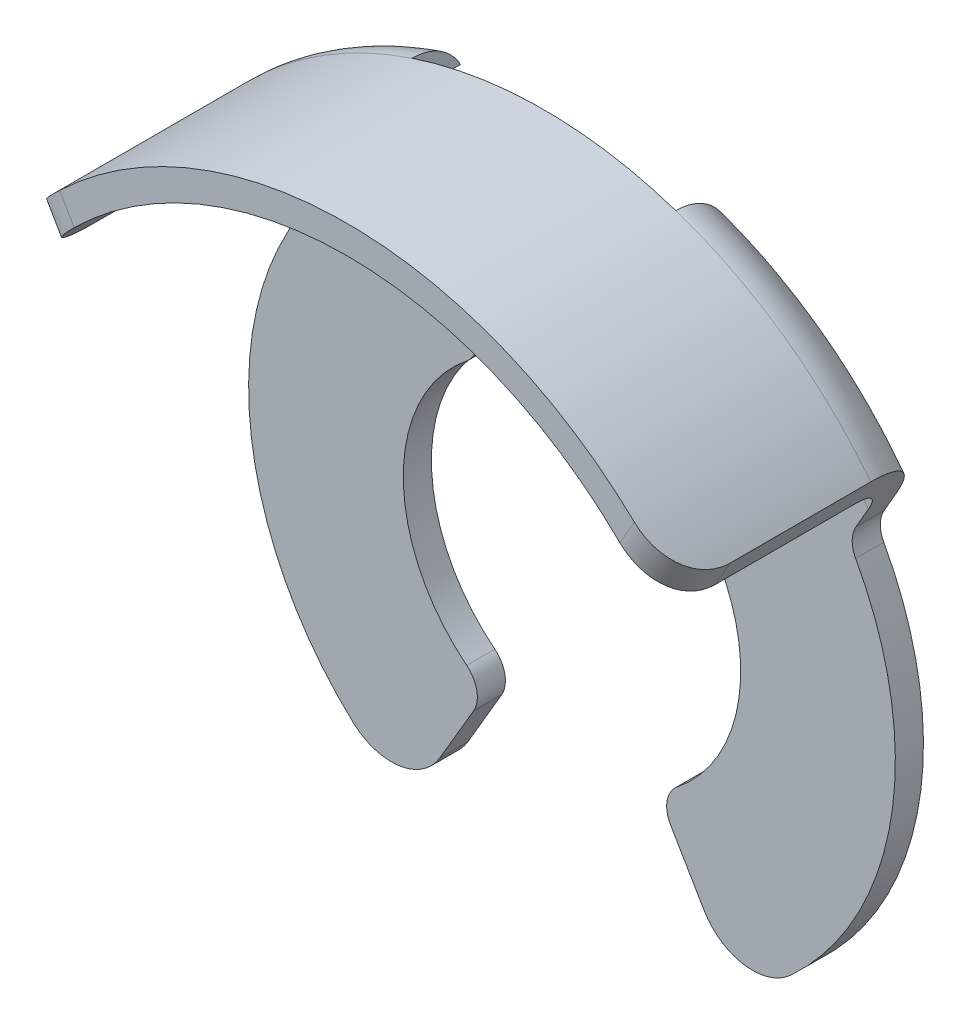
ISO-10303-21;
HEADER;
FILE_DESCRIPTION(('STEP AP214'),'2;1');
FILE_NAME('part.step','',(''),(''),'','','');
FILE_SCHEMA(('AUTOMOTIVE_DESIGN { 1 0 10303 214 1 1 1 1 }'));
ENDSEC;
DATA;
#1=APPLICATION_CONTEXT('core data for automotive mechanical design processes');
#2=APPLICATION_PROTOCOL_DEFINITION('international standard','automotive_design',2000,#1);
#3=PRODUCT_CONTEXT('',#1,'mechanical');
#4=PRODUCT('Part','Part','',(#3));
#5=PRODUCT_RELATED_PRODUCT_CATEGORY('part','',(#4));
#6=PRODUCT_DEFINITION_FORMATION('','',#4);
#7=PRODUCT_DEFINITION_CONTEXT('part definition',#1,'design');
#8=PRODUCT_DEFINITION('design','',#6,#7);
#9=PRODUCT_DEFINITION_SHAPE('','',#8);
#10=(LENGTH_UNIT() NAMED_UNIT(*) SI_UNIT(.MILLI.,.METRE.));
#11=(NAMED_UNIT(*) PLANE_ANGLE_UNIT() SI_UNIT($,.RADIAN.));
#12=(NAMED_UNIT(*) SI_UNIT($,.STERADIAN.) SOLID_ANGLE_UNIT());
#13=UNCERTAINTY_MEASURE_WITH_UNIT(LENGTH_MEASURE(1.E-05),#10,'distance_accuracy_value','');
#14=(GEOMETRIC_REPRESENTATION_CONTEXT(3) GLOBAL_UNCERTAINTY_ASSIGNED_CONTEXT((#13)) GLOBAL_UNIT_ASSIGNED_CONTEXT((#10,
#11,#12)) REPRESENTATION_CONTEXT('',''));
#15=CARTESIAN_POINT('',(0.,0.,0.));
#16=DIRECTION('',(0.,0.,1.));
#17=DIRECTION('',(1.,0.,0.));
#18=AXIS2_PLACEMENT_3D('',#15,#16,#17);
#19=CARTESIAN_POINT('',(0.,0.,-4.));
#20=DIRECTION('',(0.,0.,1.));
#21=DIRECTION('',(1.,0.,0.));
#22=AXIS2_PLACEMENT_3D('',#19,#20,#21);
#23=CYLINDRICAL_SURFACE('',#22,6.9);
#24=DIRECTION('',(0.,0.,1.));
#25=VECTOR('',#24,1.);
#26=CARTESIAN_POINT('',(2.34653901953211,6.48874060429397,-4.));
#27=LINE('',#26,#25);
#28=CARTESIAN_POINT('',(2.34653901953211,6.48874060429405,-4.36602540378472));
#29=VERTEX_POINT('',#28);
#30=CARTESIAN_POINT('',(2.34653901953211,6.48874060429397,-3.5));
#31=VERTEX_POINT('',#30);
#32=EDGE_CURVE('E253',#29,#31,#27,.T.);
#33=ORIENTED_EDGE('',*,*,#32,.F.);
#34=CARTESIAN_POINT('',(0.,0.,-4.36602540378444));
#35=DIRECTION('',(0.,0.,1.));
#36=DIRECTION('',(1.,0.,0.));
#37=AXIS2_PLACEMENT_3D('',#34,#35,#36);
#38=CIRCLE('',#37,6.9);
#39=CARTESIAN_POINT('',(2.43057540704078,6.45773204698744,-4.36602540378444));
#40=VERTEX_POINT('',#39);
#41=EDGE_CURVE('E949',#29,#40,#38,.F.);
#42=ORIENTED_EDGE('',*,*,#41,.T.);
#43=DIRECTION('',(0.,0.,1.));
#44=VECTOR('',#43,1.);
#45=CARTESIAN_POINT('',(2.43057540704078,6.45773204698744,-4.5));
#46=LINE('',#45,#44);
#47=CARTESIAN_POINT('',(2.43057540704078,6.45773204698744,-3.5));
#48=VERTEX_POINT('',#47);
#49=EDGE_CURVE('E61',#40,#48,#46,.T.);
#50=ORIENTED_EDGE('',*,*,#49,.T.);
#51=CARTESIAN_POINT('',(0.,0.,-3.5));
#52=DIRECTION('',(0.,0.,1.));
#53=DIRECTION('',(1.,0.,0.));
#54=AXIS2_PLACEMENT_3D('',#51,#52,#53);
#55=CIRCLE('',#54,6.9);
#56=CARTESIAN_POINT('',(5.54453159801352,4.10708769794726,-3.5));
#57=VERTEX_POINT('',#56);
#58=EDGE_CURVE('E525',#48,#57,#55,.F.);
#59=ORIENTED_EDGE('',*,*,#58,.T.);
#60=DIRECTION('',(0.,0.,1.));
#61=VECTOR('',#60,1.);
#62=CARTESIAN_POINT('',(5.54453159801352,4.10708769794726,-4.));
#63=LINE('',#62,#61);
#64=CARTESIAN_POINT('',(5.54453159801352,4.10708769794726,-1.));
#65=VERTEX_POINT('',#64);
#66=EDGE_CURVE('E363',#57,#65,#63,.T.);
#67=ORIENTED_EDGE('',*,*,#66,.T.);
#68=CARTESIAN_POINT('',(5.54453159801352,4.10708769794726,-1.));
#69=CARTESIAN_POINT('',(5.5445317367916,4.10708589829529,-0.973360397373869));
#70=CARTESIAN_POINT('',(5.54384039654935,4.10802097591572,-0.946734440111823));
#71=CARTESIAN_POINT('',(5.54108419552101,4.11173855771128,-0.893690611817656));
#72=CARTESIAN_POINT('',(5.53901971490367,4.11452055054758,-0.867272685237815));
#73=CARTESIAN_POINT('',(5.53080358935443,4.12556668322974,-0.788803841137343));
#74=CARTESIAN_POINT('',(5.52262905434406,4.13653147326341,-0.737307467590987));
#75=CARTESIAN_POINT('',(5.50113572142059,4.16507139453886,-0.637390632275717));
#76=CARTESIAN_POINT('',(5.48782000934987,4.18264256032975,-0.588968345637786));
#77=CARTESIAN_POINT('',(5.45639295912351,4.22355768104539,-0.496273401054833));
#78=CARTESIAN_POINT('',(5.43827854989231,4.24690533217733,-0.452003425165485));
#79=CARTESIAN_POINT('',(5.39682420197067,4.29947108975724,-0.366841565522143));
#80=CARTESIAN_POINT('',(5.37329857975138,4.32889263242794,-0.326166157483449));
#81=CARTESIAN_POINT('',(5.32198302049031,4.39182703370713,-0.251160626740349));
#82=CARTESIAN_POINT('',(5.29419146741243,4.42534144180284,-0.216832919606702));
#83=CARTESIAN_POINT('',(5.23271512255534,4.49790057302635,-0.152951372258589));
#84=CARTESIAN_POINT('',(5.19874947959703,4.53716996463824,-0.123922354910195));
#85=CARTESIAN_POINT('',(5.12722223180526,4.61784550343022,-0.0746005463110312));
#86=CARTESIAN_POINT('',(5.08966162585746,4.65925105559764,-0.054305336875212));
#87=CARTESIAN_POINT('',(5.01897647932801,4.7351914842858,-0.0258974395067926));
#88=CARTESIAN_POINT('',(4.98631487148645,4.7695820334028,-0.0162265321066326));
#89=CARTESIAN_POINT('',(4.91969588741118,4.83827677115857,-0.00327369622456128));
#90=CARTESIAN_POINT('',(4.8857391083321,4.87258099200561,1.11411790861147E-05));
#91=CARTESIAN_POINT('',(4.85138873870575,4.90652904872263,0.));
#92=B_SPLINE_CURVE_WITH_KNOTS('',3,(#68,#69,#70,#71,#72,#73,#74,#75,#76,#77,#78,#79,#80,#81,#82,
#83,#84,#85,#86,#87,#88,#89,#90,#91),.UNSPECIFIED.,.F.,.F.,(4,2,2,2,2,2,2,2,2,2,2,4),(0.,
0.0798668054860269,0.159711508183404,0.318719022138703,0.477631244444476,0.636645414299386,
0.802259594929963,0.967936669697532,1.14559613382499,1.32320637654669,1.46799454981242,
1.61271675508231),.UNSPECIFIED.);
#93=CARTESIAN_POINT('',(4.85138873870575,4.90652904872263,0.));
#94=VERTEX_POINT('',#93);
#95=EDGE_CURVE('E411',#65,#94,#92,.T.);
#96=ORIENTED_EDGE('',*,*,#95,.T.);
#97=CARTESIAN_POINT('',(0.,0.,0.));
#98=DIRECTION('',(0.,0.,1.));
#99=DIRECTION('',(1.,0.,0.));
#100=AXIS2_PLACEMENT_3D('',#97,#98,#99);
#101=CIRCLE('',#100,6.9);
#102=CARTESIAN_POINT('',(-4.85138873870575,4.90652904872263,0.));
#103=VERTEX_POINT('',#102);
#104=EDGE_CURVE('E352',#94,#103,#101,.T.);
#105=ORIENTED_EDGE('',*,*,#104,.T.);
#106=CARTESIAN_POINT('',(-4.85138873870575,4.90652904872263,0.));
#107=CARTESIAN_POINT('',(-4.89459610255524,4.86384917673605,3.29006422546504E-05));
#108=CARTESIAN_POINT('',(-4.93716700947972,4.82058838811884,-0.00517519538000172));
#109=CARTESIAN_POINT('',(-5.01997802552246,4.73426707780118,-0.0255796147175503));
#110=CARTESIAN_POINT('',(-5.06022038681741,4.69120640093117,-0.0407661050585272));
#111=CARTESIAN_POINT('',(-5.13739766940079,4.6065667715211,-0.0806313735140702));
#112=CARTESIAN_POINT('',(-5.17433325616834,4.56498752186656,-0.105308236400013));
#113=CARTESIAN_POINT('',(-5.24410987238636,4.48465571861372,-0.163503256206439));
#114=CARTESIAN_POINT('',(-5.27695022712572,4.44590363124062,-0.197022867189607));
#115=CARTESIAN_POINT('',(-5.33805167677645,4.37235780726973,-0.272427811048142));
#116=CARTESIAN_POINT('',(-5.36627471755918,4.33759760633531,-0.314376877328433));
#117=CARTESIAN_POINT('',(-5.41714391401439,4.27389951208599,-0.405495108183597));
#118=CARTESIAN_POINT('',(-5.43979035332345,4.24496132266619,-0.454663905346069));
#119=CARTESIAN_POINT('',(-5.47801679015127,4.19550600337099,-0.556661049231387));
#120=CARTESIAN_POINT('',(-5.49385858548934,4.17468049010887,-0.60924140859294));
#121=CARTESIAN_POINT('',(-5.51932013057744,4.1409610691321,-0.718268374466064));
#122=CARTESIAN_POINT('',(-5.52895089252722,4.12805312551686,-0.774707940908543));
#123=CARTESIAN_POINT('',(-5.53837787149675,4.11538497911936,-0.859786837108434));
#124=CARTESIAN_POINT('',(-5.54068430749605,4.11227761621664,-0.887702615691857));
#125=CARTESIAN_POINT('',(-5.54376027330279,4.10812920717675,-0.943740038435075));
#126=CARTESIAN_POINT('',(-5.54453149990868,4.10708587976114,-0.971861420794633));
#127=CARTESIAN_POINT('',(-5.54453159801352,4.10708769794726,-1.));
#128=B_SPLINE_CURVE_WITH_KNOTS('',3,(#106,#107,#108,#109,#110,#111,#112,#113,#114,#115,#116,
#117,#118,#119,#120,#121,#122,#123,#124,#125,#126,#127),.UNSPECIFIED.,.F.,.F.,(4,2,2,2,2,2,2,2,
2,2,4),(0.,0.181906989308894,0.36363499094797,0.54532633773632,0.727047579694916,
0.910198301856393,1.09333970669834,1.26861268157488,1.44357403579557,1.52801972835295,
1.61237203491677),.UNSPECIFIED.);
#129=CARTESIAN_POINT('',(-5.54453159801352,4.10708769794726,-1.));
#130=VERTEX_POINT('',#129);
#131=EDGE_CURVE('E403',#103,#130,#128,.T.);
#132=ORIENTED_EDGE('',*,*,#131,.T.);
#133=DIRECTION('',(0.,0.,1.));
#134=VECTOR('',#133,1.);
#135=CARTESIAN_POINT('',(-5.54453159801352,4.10708769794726,-4.));
#136=LINE('',#135,#134);
#137=CARTESIAN_POINT('',(-5.54453159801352,4.10708769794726,-3.5));
#138=VERTEX_POINT('',#137);
#139=EDGE_CURVE('E368',#130,#138,#136,.F.);
#140=ORIENTED_EDGE('',*,*,#139,.T.);
#141=CARTESIAN_POINT('',(0.,0.,-3.5));
#142=DIRECTION('',(0.,0.,1.));
#143=DIRECTION('',(1.,0.,0.));
#144=AXIS2_PLACEMENT_3D('',#141,#142,#143);
#145=CIRCLE('',#144,6.9);
#146=CARTESIAN_POINT('',(-2.43057540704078,6.45773204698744,-3.5));
#147=VERTEX_POINT('',#146);
#148=EDGE_CURVE('E522',#138,#147,#145,.F.);
#149=ORIENTED_EDGE('',*,*,#148,.T.);
#150=DIRECTION('',(0.,0.,1.));
#151=VECTOR('',#150,1.);
#152=CARTESIAN_POINT('',(-2.43057540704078,6.45773204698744,-4.5));
#153=LINE('',#152,#151);
#154=CARTESIAN_POINT('',(-2.43057540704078,6.45773204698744,-4.36602540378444));
#155=VERTEX_POINT('',#154);
#156=EDGE_CURVE('E317',#155,#147,#153,.T.);
#157=ORIENTED_EDGE('',*,*,#156,.F.);
#158=CARTESIAN_POINT('',(-2.34653901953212,6.48874060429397,-4.36602540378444));
#159=VERTEX_POINT('',#158);
#160=EDGE_CURVE('E948',#155,#159,#38,.F.);
#161=ORIENTED_EDGE('',*,*,#160,.T.);
#162=DIRECTION('',(0.,0.,1.));
#163=VECTOR('',#162,1.);
#164=CARTESIAN_POINT('',(-2.34653901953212,6.48874060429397,-4.));
#165=LINE('',#164,#163);
#166=CARTESIAN_POINT('',(-2.34653901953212,6.48874060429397,-3.5));
#167=VERTEX_POINT('',#166);
#168=EDGE_CURVE('E260',#167,#159,#165,.F.);
#169=ORIENTED_EDGE('',*,*,#168,.F.);
#170=CARTESIAN_POINT('',(0.,0.,-3.5));
#171=DIRECTION('',(0.,0.,-1.));
#172=DIRECTION('',(-1.,0.,0.));
#173=AXIS2_PLACEMENT_3D('',#170,#171,#172);
#174=CIRCLE('',#173,6.9);
#175=EDGE_CURVE('E264',#31,#167,#174,.F.);
#176=ORIENTED_EDGE('',*,*,#175,.F.);
#177=EDGE_LOOP('',(#33,#42,#50,#59,#67,#96,#105,#132,#140,#149,#157,#161,#169,#176));
#178=FACE_BOUND('',#177,.T.);
#179=ADVANCED_FACE('F32',(#178),#23,.F.);
#180=CARTESIAN_POINT('',(0.,0.,-3.5));
#181=DIRECTION('',(0.,0.,1.));
#182=DIRECTION('',(1.,0.,0.));
#183=AXIS2_PLACEMENT_3D('',#180,#181,#182);
#184=TOROIDAL_SURFACE('',#183,6.4,1.);
#185=ORIENTED_EDGE('',*,*,#41,.F.);
#186=CARTESIAN_POINT('',(2.34653901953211,4.9160596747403,-3.80414553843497));
#187=CARTESIAN_POINT('',(2.34653901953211,4.93480811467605,-3.85712993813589));
#188=CARTESIAN_POINT('',(2.34653901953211,4.95837516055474,-3.90847596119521));
#189=CARTESIAN_POINT('',(2.34653901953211,5.01402808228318,-4.00639757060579));
#190=CARTESIAN_POINT('',(2.34653901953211,5.04613315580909,-4.05296207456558));
#191=CARTESIAN_POINT('',(2.34653901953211,5.11738532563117,-4.13998554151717));
#192=CARTESIAN_POINT('',(2.34653901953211,5.15650090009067,-4.18047040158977));
#193=CARTESIAN_POINT('',(2.34653901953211,5.24054297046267,-4.25480712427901));
#194=CARTESIAN_POINT('',(2.34653901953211,5.28546773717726,-4.28866095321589));
#195=CARTESIAN_POINT('',(2.34653901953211,5.38320882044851,-4.35135071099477));
#196=CARTESIAN_POINT('',(2.34653901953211,5.43635763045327,-4.3796681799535));
#197=CARTESIAN_POINT('',(2.34653901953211,5.54643677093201,-4.42764373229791));
#198=CARTESIAN_POINT('',(2.34653901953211,5.60336868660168,-4.44729815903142));
#199=CARTESIAN_POINT('',(2.34653901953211,5.72357105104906,-4.47861983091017));
#200=CARTESIAN_POINT('',(2.34653901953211,5.78700870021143,-4.48964882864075));
#201=CARTESIAN_POINT('',(2.34653901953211,5.91484361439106,-4.50110107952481));
#202=CARTESIAN_POINT('',(2.34653901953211,5.97924104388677,-4.50152249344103));
#203=CARTESIAN_POINT('',(2.34653901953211,6.10827722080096,-4.49152560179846));
#204=CARTESIAN_POINT('',(2.34653901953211,6.17290233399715,-4.4809278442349));
#205=CARTESIAN_POINT('',(2.34653901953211,6.2993412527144,-4.44866826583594));
#206=CARTESIAN_POINT('',(2.34653901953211,6.36115542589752,-4.42700789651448));
#207=CARTESIAN_POINT('',(2.34653901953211,6.47799719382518,-4.37385552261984));
#208=CARTESIAN_POINT('',(2.34653901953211,6.53317994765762,-4.34270546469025));
#209=CARTESIAN_POINT('',(2.34653901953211,6.63709370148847,-4.27103665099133));
#210=CARTESIAN_POINT('',(2.34653901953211,6.68582693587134,-4.23052115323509));
#211=CARTESIAN_POINT('',(2.34653901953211,6.77237346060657,-4.14381160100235));
#212=CARTESIAN_POINT('',(2.34653901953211,6.81065921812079,-4.09808925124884));
#213=CARTESIAN_POINT('',(2.34653901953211,6.87844614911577,-4.00053714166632));
#214=CARTESIAN_POINT('',(2.34653901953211,6.90795063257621,-3.94870969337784));
#215=CARTESIAN_POINT('',(2.34653901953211,6.95558358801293,-3.84366169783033));
#216=CARTESIAN_POINT('',(2.34653901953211,6.97426981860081,-3.79069370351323));
#217=CARTESIAN_POINT('',(2.34653901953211,7.00209618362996,-3.68230840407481));
#218=CARTESIAN_POINT('',(2.34653901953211,7.01123875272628,-3.62689172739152));
#219=CARTESIAN_POINT('',(2.34653901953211,7.0194706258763,-3.51740077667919));
#220=CARTESIAN_POINT('',(2.34653901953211,7.01892173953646,-3.46335339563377));
#221=CARTESIAN_POINT('',(2.34653901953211,7.00867510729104,-3.35613726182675));
#222=CARTESIAN_POINT('',(2.34653901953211,6.99897817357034,-3.30296843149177));
#223=CARTESIAN_POINT('',(2.34653901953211,6.97090033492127,-3.19944232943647));
#224=CARTESIAN_POINT('',(2.34653901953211,6.95258979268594,-3.14906590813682));
#225=CARTESIAN_POINT('',(2.34653901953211,6.9079422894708,-3.05201191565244));
#226=CARTESIAN_POINT('',(2.34653901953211,6.88160482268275,-3.00533457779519));
#227=CARTESIAN_POINT('',(2.34653901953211,6.82111923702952,-2.9158914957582));
#228=CARTESIAN_POINT('',(2.34653901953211,6.78681625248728,-2.87323064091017));
#229=CARTESIAN_POINT('',(2.34653901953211,6.711815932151,-2.79396833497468));
#230=CARTESIAN_POINT('',(2.34653901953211,6.67111746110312,-2.75736796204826));
#231=CARTESIAN_POINT('',(2.34653901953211,6.58256400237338,-2.68948192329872));
#232=CARTESIAN_POINT('',(2.34653901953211,6.53446974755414,-2.65850864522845));
#233=CARTESIAN_POINT('',(2.34653901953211,6.43398876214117,-2.60456960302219));
#234=CARTESIAN_POINT('',(2.34653901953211,6.3816009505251,-2.58160586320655));
#235=CARTESIAN_POINT('',(2.34653901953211,6.27081321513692,-2.54294294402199));
#236=CARTESIAN_POINT('',(2.34653901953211,6.21224080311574,-2.52773802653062));
#237=CARTESIAN_POINT('',(2.34653901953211,6.09342574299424,-2.50682432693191));
#238=CARTESIAN_POINT('',(2.34653901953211,6.03318263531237,-2.50111818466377));
#239=CARTESIAN_POINT('',(2.34653901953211,5.90929847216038,-2.49912791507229));
#240=CARTESIAN_POINT('',(2.34653901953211,5.84564869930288,-2.50336630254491));
#241=CARTESIAN_POINT('',(2.34653901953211,5.71988301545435,-2.52216576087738));
#242=CARTESIAN_POINT('',(2.34653901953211,5.65776748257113,-2.53672935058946));
#243=CARTESIAN_POINT('',(2.34653901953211,5.53512457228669,-2.57637338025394));
#244=CARTESIAN_POINT('',(2.34653901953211,5.47468473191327,-2.60172592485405));
#245=CARTESIAN_POINT('',(2.34653901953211,5.35904504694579,-2.66245665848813));
#246=CARTESIAN_POINT('',(2.34653901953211,5.30384537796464,-2.69783518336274));
#247=CARTESIAN_POINT('',(2.34653901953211,5.20188726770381,-2.77691260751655));
#248=CARTESIAN_POINT('',(2.34653901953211,5.15495577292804,-2.82038751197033));
#249=CARTESIAN_POINT('',(2.34653901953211,5.06983969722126,-2.91520379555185));
#250=CARTESIAN_POINT('',(2.34653901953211,5.03164980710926,-2.96654036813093));
#251=CARTESIAN_POINT('',(2.34653901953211,4.96854903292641,-3.07124089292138));
#252=CARTESIAN_POINT('',(2.34653901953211,4.94281649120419,-3.12410871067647));
#253=CARTESIAN_POINT('',(2.34653901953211,4.90165347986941,-3.23373044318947));
#254=CARTESIAN_POINT('',(2.34653901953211,4.88621822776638,-3.29048254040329));
#255=CARTESIAN_POINT('',(2.34653901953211,4.86746470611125,-3.4004636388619));
#256=CARTESIAN_POINT('',(2.34653901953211,4.86314640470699,-3.45352434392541));
#257=CARTESIAN_POINT('',(2.34653901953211,4.86392597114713,-3.55951846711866));
#258=CARTESIAN_POINT('',(2.34653901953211,4.86900721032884,-3.61245194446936));
#259=CARTESIAN_POINT('',(2.34653901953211,4.88301934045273,-3.68821133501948));
#260=CARTESIAN_POINT('',(2.34653901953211,4.88835366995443,-3.71175485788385));
#261=CARTESIAN_POINT('',(2.34653901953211,4.90084935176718,-3.75834804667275));
#262=CARTESIAN_POINT('',(2.34653901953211,4.90801042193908,-3.78139778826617));
#263=CARTESIAN_POINT('',(2.34653901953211,4.9160596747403,-3.80414553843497));
#264=B_SPLINE_CURVE_WITH_KNOTS('',3,(#186,#187,#188,#189,#190,#191,#192,#193,#194,#195,#196,
#197,#198,#199,#200,#201,#202,#203,#204,#205,#206,#207,#208,#209,#210,#211,#212,#213,#214,#215,
#216,#217,#218,#219,#220,#221,#222,#223,#224,#225,#226,#227,#228,#229,#230,#231,#232,#233,#234,
#235,#236,#237,#238,#239,#240,#241,#242,#243,#244,#245,#246,#247,#248,#249,#250,#251,#252,#253,
#254,#255,#256,#257,#258,#259,#260,#261,#262,#263),.UNSPECIFIED.,.T.,.F.,(4,2,2,2,2,2,2,2,2,2,2,
2,2,2,2,2,2,2,2,2,2,2,2,2,2,2,2,2,2,2,2,2,2,2,2,2,2,2,4),(0.,0.168513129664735,
0.337408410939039,0.505562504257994,0.673666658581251,0.853560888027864,1.03353097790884,
1.22581051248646,1.41812338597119,1.61361796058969,1.80908689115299,1.99821108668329,
2.18726958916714,2.36525265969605,2.54316855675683,2.71082781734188,2.87844429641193,
3.03981685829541,3.20117509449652,3.36123753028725,3.52131005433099,3.68480284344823,
3.84832468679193,4.01918810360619,4.19009467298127,4.37083916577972,4.55163388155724,
4.74213903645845,4.9326906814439,5.1283630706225,5.32404201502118,5.51494805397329,
5.70573783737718,5.88116428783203,6.05650920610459,6.21542074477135,6.37405142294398,
6.44641019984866,6.51875780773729),.UNSPECIFIED.);
#265=CARTESIAN_POINT('',(2.34653901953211,7.01810192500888,-3.5));
#266=VERTEX_POINT('',#265);
#267=EDGE_CURVE('E11',#29,#266,#264,.T.);
#268=ORIENTED_EDGE('',*,*,#267,.T.);
#269=CARTESIAN_POINT('',(0.,0.,-3.5));
#270=DIRECTION('',(0.,0.,1.));
#271=DIRECTION('',(1.,0.,0.));
#272=AXIS2_PLACEMENT_3D('',#269,#270,#271);
#273=CIRCLE('',#272,7.4);
#274=CARTESIAN_POINT('',(5.81536724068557,4.57618879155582,-3.5));
#275=VERTEX_POINT('',#274);
#276=EDGE_CURVE('E928',#275,#266,#273,.T.);
#277=ORIENTED_EDGE('',*,*,#276,.F.);
#278=CARTESIAN_POINT('',(5.26994334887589,3.63148689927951,-4.5));
#279=CARTESIAN_POINT('',(5.30301630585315,3.68877094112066,-4.50003490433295));
#280=CARTESIAN_POINT('',(5.33611567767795,3.74610073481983,-4.4946471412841));
#281=CARTESIAN_POINT('',(5.40151366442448,3.85937337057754,-4.47300287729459));
#282=CARTESIAN_POINT('',(5.43380952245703,3.91531143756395,-4.45671320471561));
#283=CARTESIAN_POINT('',(5.49660230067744,4.02407171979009,-4.41319350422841));
#284=CARTESIAN_POINT('',(5.52709508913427,4.07688677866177,-4.3859393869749));
#285=CARTESIAN_POINT('',(5.58509620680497,4.1773476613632,-4.32090452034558));
#286=CARTESIAN_POINT('',(5.61260883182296,4.22500092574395,-4.28313921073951));
#287=CARTESIAN_POINT('',(5.66190227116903,4.31037966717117,-4.20070354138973));
#288=CARTESIAN_POINT('',(5.68394124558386,4.34855229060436,-4.15665175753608));
#289=CARTESIAN_POINT('',(5.72359939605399,4.41724222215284,-4.06115151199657));
#290=CARTESIAN_POINT('',(5.74121866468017,4.44775969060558,-4.00970320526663));
#291=CARTESIAN_POINT('',(5.76995966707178,4.49754056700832,-3.90562296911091));
#292=CARTESIAN_POINT('',(5.78150375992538,4.51753552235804,-3.85345595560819));
#293=CARTESIAN_POINT('',(5.79971227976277,4.54907360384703,-3.74586492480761));
#294=CARTESIAN_POINT('',(5.80638554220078,4.56063203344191,-3.69044700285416));
#295=CARTESIAN_POINT('',(5.812110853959,4.5705485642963,-3.6120937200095));
#296=CARTESIAN_POINT('',(5.81333197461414,4.57266360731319,-3.58972680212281));
#297=CARTESIAN_POINT('',(5.81495924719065,4.57548212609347,-3.54491045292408));
#298=CARTESIAN_POINT('',(5.81536669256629,4.57618784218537,-3.52246120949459));
#299=CARTESIAN_POINT('',(5.81536724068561,4.57618879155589,-3.50000000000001));
#300=B_SPLINE_CURVE_WITH_KNOTS('',3,(#278,#279,#280,#281,#282,#283,#284,#285,#286,#287,#288,
#289,#290,#291,#292,#293,#294,#295,#296,#297,#298,#299),.UNSPECIFIED.,.F.,.F.,(4,2,2,2,2,2,2,2,
2,2,4),(0.,0.198302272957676,0.397210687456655,0.596558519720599,0.795615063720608,
0.981561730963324,1.16750450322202,1.33778136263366,1.50774857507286,1.57520096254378,
1.64254603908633),.UNSPECIFIED.);
#301=CARTESIAN_POINT('',(5.26994334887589,3.63148689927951,-4.5));
#302=VERTEX_POINT('',#301);
#303=EDGE_CURVE('E468',#302,#275,#300,.T.);
#304=ORIENTED_EDGE('',*,*,#303,.F.);
#305=CARTESIAN_POINT('',(0.,0.,-4.5));
#306=DIRECTION('',(0.,0.,1.));
#307=DIRECTION('',(1.,0.,0.));
#308=AXIS2_PLACEMENT_3D('',#305,#306,#307);
#309=CIRCLE('',#308,6.4);
#310=CARTESIAN_POINT('',(3.07412054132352,5.61335754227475,-4.5));
#311=VERTEX_POINT('',#310);
#312=EDGE_CURVE('E616',#311,#302,#309,.F.);
#313=ORIENTED_EDGE('',*,*,#312,.F.);
#314=CARTESIAN_POINT('',(2.43057540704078,6.45773204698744,-4.36602540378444));
#315=CARTESIAN_POINT('',(2.45581711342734,6.44823328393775,-4.36601823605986));
#316=CARTESIAN_POINT('',(2.48065876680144,6.43771510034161,-4.36656487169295));
#317=CARTESIAN_POINT('',(2.52936228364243,6.41473620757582,-4.36869989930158));
#318=CARTESIAN_POINT('',(2.55322473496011,6.40227668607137,-4.37028765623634));
#319=CARTESIAN_POINT('',(2.62282841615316,6.36227845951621,-4.37648906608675));
#320=CARTESIAN_POINT('',(2.66690530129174,6.33199904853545,-4.38254248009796));
#321=CARTESIAN_POINT('',(2.74930032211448,6.26519811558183,-4.39731027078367));
#322=CARTESIAN_POINT('',(2.78762996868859,6.22868939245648,-4.4060192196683));
#323=CARTESIAN_POINT('',(2.85803408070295,6.15018218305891,-4.42459510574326));
#324=CARTESIAN_POINT('',(2.89009414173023,6.10817141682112,-4.43446462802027));
#325=CARTESIAN_POINT('',(2.94923291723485,6.01648818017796,-4.45436017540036));
#326=CARTESIAN_POINT('',(2.97581547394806,5.96648710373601,-4.46435003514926));
#327=CARTESIAN_POINT('',(3.02022884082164,5.86239534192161,-4.48160791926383));
#328=CARTESIAN_POINT('',(3.03808620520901,5.80831765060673,-4.48888418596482));
#329=CARTESIAN_POINT('',(3.05668362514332,5.73005474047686,-4.49569842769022));
#330=CARTESIAN_POINT('',(3.06132200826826,5.70692494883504,-4.49727234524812));
#331=CARTESIAN_POINT('',(3.06895885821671,5.66034787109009,-4.49942310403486));
#332=CARTESIAN_POINT('',(3.07195706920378,5.63690053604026,-4.49999978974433));
#333=CARTESIAN_POINT('',(3.07412054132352,5.61335754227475,-4.5));
#334=B_SPLINE_CURVE_WITH_KNOTS('',3,(#314,#315,#316,#317,#318,#319,#320,#321,#322,#323,#324,
#325,#326,#327,#328,#329,#330,#331,#332,#333),.UNSPECIFIED.,.F.,.F.,(4,2,2,2,2,2,2,2,2,4),(0.,
0.080852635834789,0.161656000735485,0.322252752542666,0.482523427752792,0.643158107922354,
0.814873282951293,0.986062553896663,1.05692288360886,1.12779426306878),.UNSPECIFIED.);
#335=EDGE_CURVE('E614',#40,#311,#334,.T.);
#336=ORIENTED_EDGE('',*,*,#335,.F.);
#337=EDGE_LOOP('',(#185,#268,#277,#304,#313,#336));
#338=FACE_BOUND('',#337,.T.);
#339=ADVANCED_FACE('F428',(#338),#184,.T.);
#340=CARTESIAN_POINT('',(-2.34653901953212,7.01810192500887,-3.5));
#341=VERTEX_POINT('',#340);
#342=CARTESIAN_POINT('',(-5.81536724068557,4.57618879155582,-3.5));
#343=VERTEX_POINT('',#342);
#344=EDGE_CURVE('E923',#341,#343,#273,.T.);
#345=ORIENTED_EDGE('',*,*,#344,.F.);
#346=CARTESIAN_POINT('',(-2.34653901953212,4.91605967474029,-3.80414553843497));
#347=CARTESIAN_POINT('',(-2.34653901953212,4.89901037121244,-3.75594738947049));
#348=CARTESIAN_POINT('',(-2.34653901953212,4.88591965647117,-3.70632290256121));
#349=CARTESIAN_POINT('',(-2.34653901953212,4.86826398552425,-3.60555576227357));
#350=CARTESIAN_POINT('',(-2.34653901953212,4.86370285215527,-3.55441243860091));
#351=CARTESIAN_POINT('',(-2.34653901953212,4.86333402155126,-3.45208288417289));
#352=CARTESIAN_POINT('',(-2.34653901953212,4.86752785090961,-3.40089664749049));
#353=CARTESIAN_POINT('',(-2.34653901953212,4.88446943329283,-3.29997081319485));
#354=CARTESIAN_POINT('',(-2.34653901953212,4.89721707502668,-3.25023119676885));
#355=CARTESIAN_POINT('',(-2.34653901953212,4.93067785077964,-3.15354991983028));
#356=CARTESIAN_POINT('',(-2.34653901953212,4.95138729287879,-3.10660697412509));
#357=CARTESIAN_POINT('',(-2.34653901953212,4.99993772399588,-3.0165777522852));
#358=CARTESIAN_POINT('',(-2.34653901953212,5.02778033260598,-2.9734923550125));
#359=CARTESIAN_POINT('',(-2.34653901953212,5.09159759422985,-2.88944221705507));
#360=CARTESIAN_POINT('',(-2.34653901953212,5.1279752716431,-2.84878407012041));
#361=CARTESIAN_POINT('',(-2.34653901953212,5.20652113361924,-2.77351894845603));
#362=CARTESIAN_POINT('',(-2.34653901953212,5.24869149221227,-2.73891425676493));
#363=CARTESIAN_POINT('',(-2.34653901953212,5.34174175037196,-2.67342966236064));
#364=CARTESIAN_POINT('',(-2.34653901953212,5.39306548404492,-2.64318001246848));
#365=CARTESIAN_POINT('',(-2.34653901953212,5.49979795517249,-2.5910417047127));
#366=CARTESIAN_POINT('',(-2.34653901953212,5.55520819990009,-2.56915615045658));
#367=CARTESIAN_POINT('',(-2.34653901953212,5.67288282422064,-2.5328458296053));
#368=CARTESIAN_POINT('',(-2.34653901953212,5.73535223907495,-2.51908263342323));
#369=CARTESIAN_POINT('',(-2.34653901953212,5.86170915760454,-2.50195627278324));
#370=CARTESIAN_POINT('',(-2.34653901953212,5.92559695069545,-2.49859525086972));
#371=CARTESIAN_POINT('',(-2.34653901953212,6.05460451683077,-2.50251450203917));
#372=CARTESIAN_POINT('',(-2.34653901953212,6.119716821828,-2.51005348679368));
#373=CARTESIAN_POINT('',(-2.34653901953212,6.24767490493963,-2.53625746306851));
#374=CARTESIAN_POINT('',(-2.34653901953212,6.31052087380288,-2.55492151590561));
#375=CARTESIAN_POINT('',(-2.34653901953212,6.43029081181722,-2.60246511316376));
#376=CARTESIAN_POINT('',(-2.34653901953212,6.48732825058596,-2.63105792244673));
#377=CARTESIAN_POINT('',(-2.34653901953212,6.59539469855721,-2.6979645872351));
#378=CARTESIAN_POINT('',(-2.34653901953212,6.64642568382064,-2.73627523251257));
#379=CARTESIAN_POINT('',(-2.34653901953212,6.73789545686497,-2.81922232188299));
#380=CARTESIAN_POINT('',(-2.34653901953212,6.77877055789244,-2.86337738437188));
#381=CARTESIAN_POINT('',(-2.34653901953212,6.85196002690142,-2.95829292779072));
#382=CARTESIAN_POINT('',(-2.34653901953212,6.88427767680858,-3.00905086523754));
#383=CARTESIAN_POINT('',(-2.34653901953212,6.93744256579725,-3.11247117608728));
#384=CARTESIAN_POINT('',(-2.34653901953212,6.95885538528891,-3.16484313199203));
#385=CARTESIAN_POINT('',(-2.34653901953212,6.99215934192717,-3.27253072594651));
#386=CARTESIAN_POINT('',(-2.34653901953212,7.0040531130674,-3.32784554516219));
#387=CARTESIAN_POINT('',(-2.34653901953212,7.01757582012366,-3.43741593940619));
#388=CARTESIAN_POINT('',(-2.34653901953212,7.01960395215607,-3.49162258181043));
#389=CARTESIAN_POINT('',(-2.34653901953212,7.01440579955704,-3.59958633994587));
#390=CARTESIAN_POINT('',(-2.34653901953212,7.0071805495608,-3.65334350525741));
#391=CARTESIAN_POINT('',(-2.34653901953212,6.98388547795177,-3.75820736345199));
#392=CARTESIAN_POINT('',(-2.34653901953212,6.96792495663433,-3.80933843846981));
#393=CARTESIAN_POINT('',(-2.34653901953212,6.92778973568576,-3.90826177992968));
#394=CARTESIAN_POINT('',(-2.34653901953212,6.90361467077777,-3.95605389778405));
#395=CARTESIAN_POINT('',(-2.34653901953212,6.84735828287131,-4.04788531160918));
#396=CARTESIAN_POINT('',(-2.34653901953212,6.81514569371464,-4.09184405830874));
#397=CARTESIAN_POINT('',(-2.34653901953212,6.74407350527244,-4.17400288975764));
#398=CARTESIAN_POINT('',(-2.34653901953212,6.70521282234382,-4.21220203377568));
#399=CARTESIAN_POINT('',(-2.34653901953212,6.62023495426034,-4.28351122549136));
#400=CARTESIAN_POINT('',(-2.34653901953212,6.5738808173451,-4.31633862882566));
#401=CARTESIAN_POINT('',(-2.34653901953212,6.476560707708,-4.37422981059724));
#402=CARTESIAN_POINT('',(-2.34653901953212,6.42559359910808,-4.39929167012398));
#403=CARTESIAN_POINT('',(-2.34653901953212,6.31742609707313,-4.44244761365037));
#404=CARTESIAN_POINT('',(-2.34653901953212,6.26003615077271,-4.46006649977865));
#405=CARTESIAN_POINT('',(-2.34653901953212,6.14319055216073,-4.48598081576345));
#406=CARTESIAN_POINT('',(-2.34653901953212,6.08373432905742,-4.49427364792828));
#407=CARTESIAN_POINT('',(-2.34653901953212,5.96093585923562,-4.50171272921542));
#408=CARTESIAN_POINT('',(-2.34653901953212,5.89756104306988,-4.50032592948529));
#409=CARTESIAN_POINT('',(-2.34653901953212,5.7718707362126,-4.48729060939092));
#410=CARTESIAN_POINT('',(-2.34653901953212,5.70955547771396,-4.47563986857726));
#411=CARTESIAN_POINT('',(-2.34653901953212,5.58568151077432,-4.4418343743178));
#412=CARTESIAN_POINT('',(-2.34653901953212,5.52421086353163,-4.41935533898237));
#413=CARTESIAN_POINT('',(-2.34653901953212,5.40596477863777,-4.36423096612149));
#414=CARTESIAN_POINT('',(-2.34653901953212,5.34919098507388,-4.33158208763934));
#415=CARTESIAN_POINT('',(-2.34653901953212,5.24310957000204,-4.2573739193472));
#416=CARTESIAN_POINT('',(-2.34653901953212,5.19369862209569,-4.21596274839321));
#417=CARTESIAN_POINT('',(-2.34653901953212,5.10327146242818,-4.12487216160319));
#418=CARTESIAN_POINT('',(-2.34653901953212,5.06223984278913,-4.07520823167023));
#419=CARTESIAN_POINT('',(-2.34653901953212,5.00349963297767,-3.98827421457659));
#420=CARTESIAN_POINT('',(-2.34653901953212,4.98272936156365,-3.9530415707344));
#421=CARTESIAN_POINT('',(-2.34653901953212,4.9458181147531,-3.88022413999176));
#422=CARTESIAN_POINT('',(-2.34653901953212,4.9296763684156,-3.84263974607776));
#423=CARTESIAN_POINT('',(-2.34653901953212,4.91605967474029,-3.80414553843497));
#424=B_SPLINE_CURVE_WITH_KNOTS('',3,(#346,#347,#348,#349,#350,#351,#352,#353,#354,#355,#356,
#357,#358,#359,#360,#361,#362,#363,#364,#365,#366,#367,#368,#369,#370,#371,#372,#373,#374,#375,
#376,#377,#378,#379,#380,#381,#382,#383,#384,#385,#386,#387,#388,#389,#390,#391,#392,#393,#394,
#395,#396,#397,#398,#399,#400,#401,#402,#403,#404,#405,#406,#407,#408,#409,#410,#411,#412,#413,
#414,#415,#416,#417,#418,#419,#420,#421,#422,#423),.UNSPECIFIED.,.T.,.F.,(4,2,2,2,2,2,2,2,2,2,2,
2,2,2,2,2,2,2,2,2,2,2,2,2,2,2,2,2,2,2,2,2,2,2,2,2,2,2,4),(0.,0.153232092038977,
0.306532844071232,0.459860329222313,0.613185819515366,0.766440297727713,0.919729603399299,
1.0827164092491,1.24576455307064,1.42372698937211,1.60175539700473,1.79278497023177,
1.9838538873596,2.1795329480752,2.37519550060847,2.56562206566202,2.75598580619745,
2.9355640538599,3.11507333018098,3.28396049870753,3.45280091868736,3.6147492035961,
3.77667938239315,3.93662824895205,4.09658422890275,4.25934646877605,4.4221352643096,
4.59179096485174,4.76148855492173,4.94080028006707,5.12016193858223,5.30947584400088,
5.49883071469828,5.69424656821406,5.8897305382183,6.08214191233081,6.27419623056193,
6.39659784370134,6.51897905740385),.UNSPECIFIED.);
#425=EDGE_CURVE('E46',#341,#159,#424,.T.);
#426=ORIENTED_EDGE('',*,*,#425,.T.);
#427=ORIENTED_EDGE('',*,*,#160,.F.);
#428=CARTESIAN_POINT('',(-3.07412054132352,5.61335754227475,-4.5));
#429=CARTESIAN_POINT('',(-3.06923367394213,5.66699900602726,-4.49999635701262));
#430=CARTESIAN_POINT('',(-3.05994988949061,5.72003528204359,-4.49700920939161));
#431=CARTESIAN_POINT('',(-3.03325069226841,5.82334110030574,-4.48694442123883));
#432=CARTESIAN_POINT('',(-3.01587868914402,5.87362383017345,-4.47988856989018));
#433=CARTESIAN_POINT('',(-2.97367808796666,5.97028516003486,-4.4635535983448));
#434=CARTESIAN_POINT('',(-2.94887703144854,6.01667738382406,-4.45428271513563));
#435=CARTESIAN_POINT('',(-2.89234066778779,6.10502724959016,-4.43518092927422));
#436=CARTESIAN_POINT('',(-2.8605914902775,6.14697576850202,-4.42534893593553));
#437=CARTESIAN_POINT('',(-2.78785486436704,6.22879372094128,-4.40599948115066));
#438=CARTESIAN_POINT('',(-2.74631875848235,6.26820023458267,-4.39657615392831));
#439=CARTESIAN_POINT('',(-2.65680003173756,6.33951668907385,-4.38096063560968));
#440=CARTESIAN_POINT('',(-2.60883459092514,6.37144600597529,-4.37476004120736));
#441=CARTESIAN_POINT('',(-2.53784251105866,6.41030513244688,-4.36926557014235));
#442=CARTESIAN_POINT('',(-2.51687168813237,6.42084078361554,-4.36805613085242));
#443=CARTESIAN_POINT('',(-2.47422672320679,6.44041776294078,-4.36643488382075));
#444=CARTESIAN_POINT('',(-2.45255293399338,6.44945982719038,-4.36602268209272));
#445=CARTESIAN_POINT('',(-2.43057540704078,6.45773204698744,-4.36602540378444));
#446=B_SPLINE_CURVE_WITH_KNOTS('',3,(#428,#429,#430,#431,#432,#433,#434,#435,#436,#437,#438,
#439,#440,#441,#442,#443,#444,#445),.UNSPECIFIED.,.F.,.F.,(4,2,2,2,2,2,2,2,4),(0.,
0.161046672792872,0.321238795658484,0.480844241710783,0.640771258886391,0.813996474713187,
0.986767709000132,1.05720726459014,1.12761200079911),.UNSPECIFIED.);
#447=CARTESIAN_POINT('',(-3.07412054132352,5.61335754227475,-4.5));
#448=VERTEX_POINT('',#447);
#449=EDGE_CURVE('E412',#448,#155,#446,.T.);
#450=ORIENTED_EDGE('',*,*,#449,.F.);
#451=CARTESIAN_POINT('',(0.,0.,-4.5));
#452=DIRECTION('',(0.,0.,1.));
#453=DIRECTION('',(1.,0.,0.));
#454=AXIS2_PLACEMENT_3D('',#451,#452,#453);
#455=CIRCLE('',#454,6.4);
#456=CARTESIAN_POINT('',(-5.26994334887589,3.63148689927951,-4.5));
#457=VERTEX_POINT('',#456);
#458=EDGE_CURVE('E620',#457,#448,#455,.F.);
#459=ORIENTED_EDGE('',*,*,#458,.F.);
#460=CARTESIAN_POINT('',(-5.81536724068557,4.57618879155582,-3.5));
#461=CARTESIAN_POINT('',(-5.81536759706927,4.5761894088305,-3.52662319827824));
#462=CARTESIAN_POINT('',(-5.81479430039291,4.57519642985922,-3.55323315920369));
#463=CARTESIAN_POINT('',(-5.81251024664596,4.57124033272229,-3.60625245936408));
#464=CARTESIAN_POINT('',(-5.81079968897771,4.56827755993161,-3.63266183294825));
#465=CARTESIAN_POINT('',(-5.80399209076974,4.55648645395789,-3.71116316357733));
#466=CARTESIAN_POINT('',(-5.7972189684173,4.54475506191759,-3.76271211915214));
#467=CARTESIAN_POINT('',(-5.77946037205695,4.51399627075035,-3.86277197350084));
#468=CARTESIAN_POINT('',(-5.76847546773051,4.49496985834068,-3.911283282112));
#469=CARTESIAN_POINT('',(-5.74268986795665,4.45030788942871,-4.00407568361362));
#470=CARTESIAN_POINT('',(-5.72788791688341,4.4246701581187,-4.04835537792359));
#471=CARTESIAN_POINT('',(-5.69452682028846,4.36688704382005,-4.13276536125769));
#472=CARTESIAN_POINT('',(-5.67587798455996,4.33458631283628,-4.17275345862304));
#473=CARTESIAN_POINT('',(-5.63568034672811,4.26496196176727,-4.24637846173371));
#474=CARTESIAN_POINT('',(-5.6141310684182,4.22763751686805,-4.28001432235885));
#475=CARTESIAN_POINT('',(-5.5672080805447,4.14636451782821,-4.34243397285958));
#476=CARTESIAN_POINT('',(-5.54167427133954,4.10213866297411,-4.37073560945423));
#477=CARTESIAN_POINT('',(-5.48871464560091,4.01040990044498,-4.41911079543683));
#478=CARTESIAN_POINT('',(-5.46128744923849,3.96290460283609,-4.43917826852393));
#479=CARTESIAN_POINT('',(-5.40671968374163,3.86839046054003,-4.47007266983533));
#480=CARTESIAN_POINT('',(-5.37963897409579,3.82148529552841,-4.4813275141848));
#481=CARTESIAN_POINT('',(-5.32501583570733,3.72687524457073,-4.49629059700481));
#482=CARTESIAN_POINT('',(-5.29747446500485,3.67917219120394,-4.50001422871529));
#483=CARTESIAN_POINT('',(-5.26994334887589,3.63148689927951,-4.5));
#484=B_SPLINE_CURVE_WITH_KNOTS('',3,(#460,#461,#462,#463,#464,#465,#466,#467,#468,#469,#470,
#471,#472,#473,#474,#475,#476,#477,#478,#479,#480,#481,#482,#483),.UNSPECIFIED.,.F.,.F.,(4,2,2,
2,2,2,2,2,2,2,2,4),(0.,0.0798188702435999,0.159623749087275,0.318689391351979,0.477733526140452,
0.636830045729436,0.80017043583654,0.963537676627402,1.13795628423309,1.31250337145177,
1.47793322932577,1.64302461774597),.UNSPECIFIED.);
#485=EDGE_CURVE('E621',#343,#457,#484,.T.);
#486=ORIENTED_EDGE('',*,*,#485,.F.);
#487=EDGE_LOOP('',(#345,#426,#427,#450,#459,#486));
#488=FACE_BOUND('',#487,.T.);
#489=ADVANCED_FACE('F877',(#488),#184,.T.);
#490=CARTESIAN_POINT('',(0.,0.,-4.5));
#491=DIRECTION('',(0.,0.,1.));
#492=DIRECTION('',(1.,0.,0.));
#493=AXIS2_PLACEMENT_3D('',#490,#491,#492);
#494=PLANE('',#493);
#495=CARTESIAN_POINT('',(0.,0.,-4.5));
#496=DIRECTION('',(0.,0.,1.));
#497=DIRECTION('',(1.,0.,0.));
#498=AXIS2_PLACEMENT_3D('',#495,#496,#497);
#499=CIRCLE('',#498,3.);
#500=CARTESIAN_POINT('',(-1.87151240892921,2.34466230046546,-4.5));
#501=VERTEX_POINT('',#500);
#502=CARTESIAN_POINT('',(-1.87151240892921,-2.34466230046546,-4.5));
#503=VERTEX_POINT('',#502);
#504=EDGE_CURVE('E356',#501,#503,#499,.T.);
#505=ORIENTED_EDGE('',*,*,#504,.T.);
#506=CARTESIAN_POINT('',(-2.18343114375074,-2.73543935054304,-4.5));
#507=DIRECTION('',(0.,0.,1.));
#508=DIRECTION('',(1.,0.,0.));
#509=AXIS2_PLACEMENT_3D('',#506,#507,#508);
#510=CIRCLE('',#509,0.5);
#511=CARTESIAN_POINT('',(-1.75210235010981,-2.98833354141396,-4.5));
#512=VERTEX_POINT('',#511);
#513=EDGE_CURVE('E514',#503,#512,#510,.F.);
#514=ORIENTED_EDGE('',*,*,#513,.T.);
#515=DIRECTION('',(-0.505788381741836,-0.862657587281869,0.));
#516=VECTOR('',#515,1.);
#517=CARTESIAN_POINT('',(-1.51736514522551,-2.58797276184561,-4.5));
#518=LINE('',#517,#516);
#519=CARTESIAN_POINT('',(-2.34865055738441,-4.00578838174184,-4.5));
#520=VERTEX_POINT('',#519);
#521=EDGE_CURVE('E274',#512,#520,#518,.T.);
#522=ORIENTED_EDGE('',*,*,#521,.T.);
#523=CARTESIAN_POINT('',(-3.21130814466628,-3.5,-4.5));
#524=DIRECTION('',(0.,0.,-1.));
#525=DIRECTION('',(-1.,0.,0.));
#526=AXIS2_PLACEMENT_3D('',#523,#524,#525);
#527=CIRCLE('',#526,1.);
#528=CARTESIAN_POINT('',(-3.8873730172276,-4.23684210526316,-4.5));
#529=VERTEX_POINT('',#528);
#530=EDGE_CURVE('E276',#520,#529,#527,.T.);
#531=ORIENTED_EDGE('',*,*,#530,.T.);
#532=CARTESIAN_POINT('',(0.,0.,-4.5));
#533=DIRECTION('',(0.,0.,-1.));
#534=DIRECTION('',(1.,0.,0.));
#535=AXIS2_PLACEMENT_3D('',#532,#533,#534);
#536=CIRCLE('',#535,5.75);
#537=CARTESIAN_POINT('',(-5.04419372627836,2.76018290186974,-4.5));
#538=VERTEX_POINT('',#537);
#539=EDGE_CURVE('E335',#529,#538,#536,.T.);
#540=ORIENTED_EDGE('',*,*,#539,.T.);
#541=CARTESIAN_POINT('',(-5.48281926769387,3.00019880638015,-4.5));
#542=DIRECTION('',(0.,0.,1.));
#543=DIRECTION('',(1.,0.,0.));
#544=AXIS2_PLACEMENT_3D('',#541,#542,#543);
#545=CIRCLE('',#544,0.5);
#546=CARTESIAN_POINT('',(-5.04980656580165,3.25019880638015,-4.5));
#547=VERTEX_POINT('',#546);
#548=EDGE_CURVE('E529',#538,#547,#545,.T.);
#549=ORIENTED_EDGE('',*,*,#548,.T.);
#550=DIRECTION('',(-0.5,0.866025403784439,0.));
#551=VECTOR('',#550,1.);
#552=CARTESIAN_POINT('',(-5.81536724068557,4.57618879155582,-4.5));
#553=LINE('',#552,#551);
#554=EDGE_CURVE('E338',#547,#457,#553,.T.);
#555=ORIENTED_EDGE('',*,*,#554,.T.);
#556=ORIENTED_EDGE('',*,*,#458,.T.);
#557=CARTESIAN_POINT('',(-2.07831810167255,5.52182885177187,-4.5));
#558=DIRECTION('',(0.,0.,1.));
#559=DIRECTION('',(-1.,0.,0.));
#560=AXIS2_PLACEMENT_3D('',#557,#558,#559);
#561=CIRCLE('',#560,1.);
#562=CARTESIAN_POINT('',(-2.94097568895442,5.01604047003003,-4.5));
#563=VERTEX_POINT('',#562);
#564=EDGE_CURVE('E291',#448,#563,#561,.T.);
#565=ORIENTED_EDGE('',*,*,#564,.T.);
#566=DIRECTION('',(0.505788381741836,-0.862657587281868,0.));
#567=VECTOR('',#566,1.);
#568=CARTESIAN_POINT('',(-1.51736514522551,2.58797276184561,-4.5));
#569=LINE('',#568,#567);
#570=CARTESIAN_POINT('',(-1.75210235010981,2.98833354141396,-4.5));
#571=VERTEX_POINT('',#570);
#572=EDGE_CURVE('E293',#563,#571,#569,.T.);
#573=ORIENTED_EDGE('',*,*,#572,.T.);
#574=CARTESIAN_POINT('',(-2.18343114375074,2.73543935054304,-4.5));
#575=DIRECTION('',(0.,0.,1.));
#576=DIRECTION('',(1.,0.,0.));
#577=AXIS2_PLACEMENT_3D('',#574,#575,#576);
#578=CIRCLE('',#577,0.5);
#579=EDGE_CURVE('E512',#571,#501,#578,.F.);
#580=ORIENTED_EDGE('',*,*,#579,.T.);
#581=EDGE_LOOP('',(#505,#514,#522,#531,#540,#549,#555,#556,#565,#573,#580));
#582=FACE_BOUND('',#581,.T.);
#583=ADVANCED_FACE('F442',(#582),#494,.F.);
#584=CARTESIAN_POINT('',(0.,0.,-4.5));
#585=DIRECTION('',(0.,0.,1.));
#586=DIRECTION('',(1.,0.,0.));
#587=AXIS2_PLACEMENT_3D('',#584,#585,#586);
#588=CYLINDRICAL_SURFACE('',#587,3.);
#589=CARTESIAN_POINT('',(0.,0.,-4.));
#590=DIRECTION('',(0.,0.,1.));
#591=DIRECTION('',(1.,0.,0.));
#592=AXIS2_PLACEMENT_3D('',#589,#590,#591);
#593=CIRCLE('',#592,3.);
#594=CARTESIAN_POINT('',(-1.87151240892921,-2.34466230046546,-4.));
#595=VERTEX_POINT('',#594);
#596=CARTESIAN_POINT('',(-1.87151240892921,2.34466230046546,-4.));
#597=VERTEX_POINT('',#596);
#598=EDGE_CURVE('E364',#595,#597,#593,.F.);
#599=ORIENTED_EDGE('',*,*,#598,.F.);
#600=DIRECTION('',(0.,0.,1.));
#601=VECTOR('',#600,1.);
#602=CARTESIAN_POINT('',(-1.87151240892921,-2.34466230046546,-4.5));
#603=LINE('',#602,#601);
#604=EDGE_CURVE('E510',#595,#503,#603,.F.);
#605=ORIENTED_EDGE('',*,*,#604,.T.);
#606=ORIENTED_EDGE('',*,*,#504,.F.);
#607=DIRECTION('',(0.,0.,1.));
#608=VECTOR('',#607,1.);
#609=CARTESIAN_POINT('',(-1.87151240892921,2.34466230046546,-4.5));
#610=LINE('',#609,#608);
#611=EDGE_CURVE('E507',#501,#597,#610,.T.);
#612=ORIENTED_EDGE('',*,*,#611,.T.);
#613=EDGE_LOOP('',(#599,#605,#606,#612));
#614=FACE_BOUND('',#613,.T.);
#615=ADVANCED_FACE('F437',(#614),#588,.F.);
#616=CARTESIAN_POINT('',(0.,0.,-4.));
#617=DIRECTION('',(0.,0.,1.));
#618=DIRECTION('',(1.,0.,0.));
#619=AXIS2_PLACEMENT_3D('',#616,#617,#618);
#620=PLANE('',#619);
#621=DIRECTION('',(-0.505788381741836,-0.862657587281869,0.));
#622=VECTOR('',#621,1.);
#623=CARTESIAN_POINT('',(-1.51736514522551,-2.58797276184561,-4.));
#624=LINE('',#623,#622);
#625=CARTESIAN_POINT('',(-1.75210235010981,-2.98833354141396,-4.));
#626=VERTEX_POINT('',#625);
#627=CARTESIAN_POINT('',(-2.34865055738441,-4.00578838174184,-4.));
#628=VERTEX_POINT('',#627);
#629=EDGE_CURVE('E259',#626,#628,#624,.T.);
#630=ORIENTED_EDGE('',*,*,#629,.F.);
#631=CARTESIAN_POINT('',(-2.18343114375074,-2.73543935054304,-4.));
#632=DIRECTION('',(0.,0.,1.));
#633=DIRECTION('',(1.,0.,0.));
#634=AXIS2_PLACEMENT_3D('',#631,#632,#633);
#635=CIRCLE('',#634,0.5);
#636=EDGE_CURVE('E505',#626,#595,#635,.T.);
#637=ORIENTED_EDGE('',*,*,#636,.T.);
#638=ORIENTED_EDGE('',*,*,#598,.T.);
#639=CARTESIAN_POINT('',(-2.18343114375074,2.73543935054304,-4.));
#640=DIRECTION('',(0.,0.,1.));
#641=DIRECTION('',(1.,0.,0.));
#642=AXIS2_PLACEMENT_3D('',#639,#640,#641);
#643=CIRCLE('',#642,0.5);
#644=CARTESIAN_POINT('',(-1.75210235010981,2.98833354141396,-4.));
#645=VERTEX_POINT('',#644);
#646=EDGE_CURVE('E502',#597,#645,#643,.T.);
#647=ORIENTED_EDGE('',*,*,#646,.T.);
#648=DIRECTION('',(0.505788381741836,-0.862657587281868,0.));
#649=VECTOR('',#648,1.);
#650=CARTESIAN_POINT('',(-1.51736514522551,2.58797276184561,-4.));
#651=LINE('',#650,#649);
#652=CARTESIAN_POINT('',(-2.94097568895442,5.01604047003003,-4.));
#653=VERTEX_POINT('',#652);
#654=EDGE_CURVE('E277',#653,#645,#651,.T.);
#655=ORIENTED_EDGE('',*,*,#654,.F.);
#656=CARTESIAN_POINT('',(-2.07831810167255,5.52182885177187,-4.));
#657=DIRECTION('',(0.,0.,1.));
#658=DIRECTION('',(-1.,0.,0.));
#659=AXIS2_PLACEMENT_3D('',#656,#657,#658);
#660=CIRCLE('',#659,1.);
#661=CARTESIAN_POINT('',(-3.07412054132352,5.61335754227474,-4.));
#662=VERTEX_POINT('',#661);
#663=EDGE_CURVE('E310',#662,#653,#660,.T.);
#664=ORIENTED_EDGE('',*,*,#663,.F.);
#665=CARTESIAN_POINT('',(0.,0.,-4.));
#666=DIRECTION('',(0.,0.,1.));
#667=DIRECTION('',(1.,0.,0.));
#668=AXIS2_PLACEMENT_3D('',#665,#666,#667);
#669=CIRCLE('',#668,6.4);
#670=CARTESIAN_POINT('',(-5.26994334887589,3.63148689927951,-4.));
#671=VERTEX_POINT('',#670);
#672=EDGE_CURVE('E499',#662,#671,#669,.T.);
#673=ORIENTED_EDGE('',*,*,#672,.T.);
#674=DIRECTION('',(-0.5,0.866025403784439,0.));
#675=VECTOR('',#674,1.);
#676=CARTESIAN_POINT('',(-2.3799775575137,-1.3740806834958,-4.));
#677=LINE('',#676,#675);
#678=CARTESIAN_POINT('',(-5.04980656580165,3.25019880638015,-4.));
#679=VERTEX_POINT('',#678);
#680=EDGE_CURVE('E349',#679,#671,#677,.T.);
#681=ORIENTED_EDGE('',*,*,#680,.F.);
#682=CARTESIAN_POINT('',(-5.48281926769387,3.00019880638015,-4.));
#683=DIRECTION('',(0.,0.,1.));
#684=DIRECTION('',(1.,0.,0.));
#685=AXIS2_PLACEMENT_3D('',#682,#683,#684);
#686=CIRCLE('',#685,0.5);
#687=CARTESIAN_POINT('',(-5.04419372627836,2.76018290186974,-4.));
#688=VERTEX_POINT('',#687);
#689=EDGE_CURVE('E527',#679,#688,#686,.F.);
#690=ORIENTED_EDGE('',*,*,#689,.T.);
#691=CARTESIAN_POINT('',(0.,0.,-4.));
#692=DIRECTION('',(0.,0.,1.));
#693=DIRECTION('',(1.,0.,0.));
#694=AXIS2_PLACEMENT_3D('',#691,#692,#693);
#695=CIRCLE('',#694,5.75);
#696=CARTESIAN_POINT('',(-3.8873730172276,-4.23684210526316,-4.));
#697=VERTEX_POINT('',#696);
#698=EDGE_CURVE('E371',#697,#688,#695,.F.);
#699=ORIENTED_EDGE('',*,*,#698,.F.);
#700=CARTESIAN_POINT('',(-3.21130814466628,-3.5,-4.));
#701=DIRECTION('',(0.,0.,-1.));
#702=DIRECTION('',(-1.,0.,0.));
#703=AXIS2_PLACEMENT_3D('',#700,#701,#702);
#704=CIRCLE('',#703,1.);
#705=EDGE_CURVE('E297',#628,#697,#704,.T.);
#706=ORIENTED_EDGE('',*,*,#705,.F.);
#707=EDGE_LOOP('',(#630,#637,#638,#647,#655,#664,#673,#681,#690,#699,#706));
#708=FACE_BOUND('',#707,.T.);
#709=ADVANCED_FACE('F450',(#708),#620,.T.);
#710=CARTESIAN_POINT('',(0.,0.,-4.5));
#711=DIRECTION('',(0.,0.,1.));
#712=DIRECTION('',(1.,0.,0.));
#713=AXIS2_PLACEMENT_3D('',#710,#711,#712);
#714=CYLINDRICAL_SURFACE('',#713,5.75);
#715=CARTESIAN_POINT('',(5.04419372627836,2.76018290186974,-4.5));
#716=VERTEX_POINT('',#715);
#717=CARTESIAN_POINT('',(3.8873730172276,-4.23684210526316,-4.5));
#718=VERTEX_POINT('',#717);
#719=EDGE_CURVE('E336',#716,#718,#536,.T.);
#720=ORIENTED_EDGE('',*,*,#719,.F.);
#721=DIRECTION('',(0.,0.,1.));
#722=VECTOR('',#721,1.);
#723=CARTESIAN_POINT('',(5.04419372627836,2.76018290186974,-4.5));
#724=LINE('',#723,#722);
#725=CARTESIAN_POINT('',(5.04419372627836,2.76018290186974,-4.));
#726=VERTEX_POINT('',#725);
#727=EDGE_CURVE('E473',#716,#726,#724,.T.);
#728=ORIENTED_EDGE('',*,*,#727,.T.);
#729=CARTESIAN_POINT('',(3.88737301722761,-4.23684210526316,-4.));
#730=VERTEX_POINT('',#729);
#731=EDGE_CURVE('E372',#726,#730,#695,.F.);
#732=ORIENTED_EDGE('',*,*,#731,.T.);
#733=DIRECTION('',(0.,0.,1.));
#734=VECTOR('',#733,1.);
#735=CARTESIAN_POINT('',(3.88737301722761,-4.23684210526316,-4.5));
#736=LINE('',#735,#734);
#737=EDGE_CURVE('E325',#718,#730,#736,.T.);
#738=ORIENTED_EDGE('',*,*,#737,.F.);
#739=EDGE_LOOP('',(#720,#728,#732,#738));
#740=FACE_BOUND('',#739,.T.);
#741=ADVANCED_FACE('F435',(#740),#714,.T.);
#742=CARTESIAN_POINT('',(1.87151240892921,-2.34466230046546,-4.5));
#743=VERTEX_POINT('',#742);
#744=CARTESIAN_POINT('',(1.87151240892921,2.34466230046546,-4.5));
#745=VERTEX_POINT('',#744);
#746=EDGE_CURVE('E360',#743,#745,#499,.T.);
#747=ORIENTED_EDGE('',*,*,#746,.F.);
#748=DIRECTION('',(0.,0.,1.));
#749=VECTOR('',#748,1.);
#750=CARTESIAN_POINT('',(1.87151240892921,-2.34466230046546,-4.5));
#751=LINE('',#750,#749);
#752=CARTESIAN_POINT('',(1.87151240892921,-2.34466230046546,-4.));
#753=VERTEX_POINT('',#752);
#754=EDGE_CURVE('E480',#743,#753,#751,.T.);
#755=ORIENTED_EDGE('',*,*,#754,.T.);
#756=CARTESIAN_POINT('',(1.87151240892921,2.34466230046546,-4.));
#757=VERTEX_POINT('',#756);
#758=EDGE_CURVE('E355',#757,#753,#593,.F.);
#759=ORIENTED_EDGE('',*,*,#758,.F.);
#760=DIRECTION('',(0.,0.,1.));
#761=VECTOR('',#760,1.);
#762=CARTESIAN_POINT('',(1.87151240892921,2.34466230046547,-4.5));
#763=LINE('',#762,#761);
#764=EDGE_CURVE('E478',#757,#745,#763,.F.);
#765=ORIENTED_EDGE('',*,*,#764,.T.);
#766=EDGE_LOOP('',(#747,#755,#759,#765));
#767=FACE_BOUND('',#766,.T.);
#768=ADVANCED_FACE('F431',(#767),#588,.F.);
#769=CARTESIAN_POINT('',(0.,0.,-4.5));
#770=DIRECTION('',(0.,0.,1.));
#771=DIRECTION('',(1.,0.,0.));
#772=AXIS2_PLACEMENT_3D('',#769,#770,#771);
#773=CYLINDRICAL_SURFACE('',#772,7.4);
#774=DIRECTION('',(0.,0.,1.));
#775=VECTOR('',#774,1.);
#776=CARTESIAN_POINT('',(5.81536724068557,4.57618879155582,-4.5));
#777=LINE('',#776,#775);
#778=CARTESIAN_POINT('',(5.81536724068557,4.57618879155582,-1.));
#779=VERTEX_POINT('',#778);
#780=EDGE_CURVE('E340',#275,#779,#777,.T.);
#781=ORIENTED_EDGE('',*,*,#780,.F.);
#782=ORIENTED_EDGE('',*,*,#276,.T.);
#783=EDGE_CURVE('E53',#266,#341,#273,.T.);
#784=ORIENTED_EDGE('',*,*,#783,.T.);
#785=ORIENTED_EDGE('',*,*,#344,.T.);
#786=DIRECTION('',(0.,0.,1.));
#787=VECTOR('',#786,1.);
#788=CARTESIAN_POINT('',(-5.81536724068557,4.57618879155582,-4.5));
#789=LINE('',#788,#787);
#790=CARTESIAN_POINT('',(-5.81536724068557,4.57618879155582,-1.));
#791=VERTEX_POINT('',#790);
#792=EDGE_CURVE('E341',#343,#791,#789,.T.);
#793=ORIENTED_EDGE('',*,*,#792,.T.);
#794=CARTESIAN_POINT('',(-5.81536724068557,4.57618879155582,-1.));
#795=CARTESIAN_POINT('',(-5.8153673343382,4.57618721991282,-0.973160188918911));
#796=CARTESIAN_POINT('',(-5.81464710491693,4.57710408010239,-0.946333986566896));
#797=CARTESIAN_POINT('',(-5.81177536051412,4.58075050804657,-0.892888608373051));
#798=CARTESIAN_POINT('',(-5.80962419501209,4.5834796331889,-0.866269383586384));
#799=CARTESIAN_POINT('',(-5.80106029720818,4.59432138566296,-0.787179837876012));
#800=CARTESIAN_POINT('',(-5.79253697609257,4.60508880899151,-0.735263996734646));
#801=CARTESIAN_POINT('',(-5.77011686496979,4.63314891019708,-0.634516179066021));
#802=CARTESIAN_POINT('',(-5.75622249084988,4.65043865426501,-0.585682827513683));
#803=CARTESIAN_POINT('',(-5.72342433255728,4.6907448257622,-0.492222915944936));
#804=CARTESIAN_POINT('',(-5.70451786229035,4.71376432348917,-0.447598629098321));
#805=CARTESIAN_POINT('',(-5.66136883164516,4.76550890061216,-0.362043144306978));
#806=CARTESIAN_POINT('',(-5.63695813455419,4.7944100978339,-0.321303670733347));
#807=CARTESIAN_POINT('',(-5.58375519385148,4.85626824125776,-0.246267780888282));
#808=CARTESIAN_POINT('',(-5.55496136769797,4.88922665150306,-0.211973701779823));
#809=CARTESIAN_POINT('',(-5.49164919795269,4.9602607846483,-0.148617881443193));
#810=CARTESIAN_POINT('',(-5.45688624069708,4.99852726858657,-0.120014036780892));
#811=CARTESIAN_POINT('',(-5.38381618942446,5.07714495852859,-0.0715605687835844));
#812=CARTESIAN_POINT('',(-5.3455102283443,5.11749549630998,-0.051708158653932));
#813=CARTESIAN_POINT('',(-5.27443058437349,5.19060801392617,-0.0244449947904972));
#814=CARTESIAN_POINT('',(-5.24214860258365,5.22321580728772,-0.0153113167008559));
#815=CARTESIAN_POINT('',(-5.17643123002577,5.28835849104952,-0.00308546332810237));
#816=CARTESIAN_POINT('',(-5.14299654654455,5.32089341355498,1.03518785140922E-05));
#817=CARTESIAN_POINT('',(-5.10922446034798,5.35311361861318,0.));
#818=B_SPLINE_CURVE_WITH_KNOTS('',3,(#794,#795,#796,#797,#798,#799,#800,#801,#802,#803,#804,
#805,#806,#807,#808,#809,#810,#811,#812,#813,#814,#815,#816,#817),.UNSPECIFIED.,.F.,.F.,(4,2,2,
2,2,2,2,2,2,2,2,4),(0.,0.0804674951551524,0.160915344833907,0.321178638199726,0.481369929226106,
0.641647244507,0.807716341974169,0.973845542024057,1.15030390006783,1.32670602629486,
1.46666972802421,1.60654902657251),.UNSPECIFIED.);
#819=CARTESIAN_POINT('',(-5.10922446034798,5.35311361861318,0.));
#820=VERTEX_POINT('',#819);
#821=EDGE_CURVE('E374',#791,#820,#818,.T.);
#822=ORIENTED_EDGE('',*,*,#821,.T.);
#823=CARTESIAN_POINT('',(0.,0.,0.));
#824=DIRECTION('',(0.,0.,1.));
#825=DIRECTION('',(1.,0.,0.));
#826=AXIS2_PLACEMENT_3D('',#823,#824,#825);
#827=CIRCLE('',#826,7.4);
#828=CARTESIAN_POINT('',(5.10922446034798,5.35311361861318,0.));
#829=VERTEX_POINT('',#828);
#830=EDGE_CURVE('E359',#829,#820,#827,.T.);
#831=ORIENTED_EDGE('',*,*,#830,.F.);
#832=CARTESIAN_POINT('',(5.10922446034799,5.35311361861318,0.));
#833=CARTESIAN_POINT('',(5.15272641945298,5.31163146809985,3.51512038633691E-05));
#834=CARTESIAN_POINT('',(5.19565685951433,5.26960775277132,-0.00511492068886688));
#835=CARTESIAN_POINT('',(5.2792907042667,5.18579629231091,-0.0253135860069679));
#836=CARTESIAN_POINT('',(5.31999615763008,5.14400836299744,-0.040352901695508));
#837=CARTESIAN_POINT('',(5.3981774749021,5.06190923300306,-0.0798577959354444));
#838=CARTESIAN_POINT('',(5.43565366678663,5.02159788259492,-0.104322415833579));
#839=CARTESIAN_POINT('',(5.50654151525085,4.94376034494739,-0.162023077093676));
#840=CARTESIAN_POINT('',(5.53995274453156,4.90623445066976,-0.195260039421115));
#841=CARTESIAN_POINT('',(5.60215168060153,4.83509549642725,-0.269957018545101));
#842=CARTESIAN_POINT('',(5.63090806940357,4.80150932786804,-0.311468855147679));
#843=CARTESIAN_POINT('',(5.68282852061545,4.73994571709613,-0.401579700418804));
#844=CARTESIAN_POINT('',(5.70599264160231,4.71196821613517,-0.450178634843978));
#845=CARTESIAN_POINT('',(5.7453303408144,4.66391590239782,-0.551242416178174));
#846=CARTESIAN_POINT('',(5.76173041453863,4.64358748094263,-0.603498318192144));
#847=CARTESIAN_POINT('',(5.78821219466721,4.61053731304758,-0.71183894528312));
#848=CARTESIAN_POINT('',(5.79830391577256,4.59780351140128,-0.767917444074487));
#849=CARTESIAN_POINT('',(5.8084982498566,4.58490735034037,-0.853805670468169));
#850=CARTESIAN_POINT('',(5.81107274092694,4.58164220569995,-0.882903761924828));
#851=CARTESIAN_POINT('',(5.81450634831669,4.57728299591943,-0.941328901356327));
#852=CARTESIAN_POINT('',(5.81536741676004,4.57618646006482,-0.970655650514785));
#853=CARTESIAN_POINT('',(5.81536724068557,4.57618879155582,-1.));
#854=B_SPLINE_CURVE_WITH_KNOTS('',3,(#832,#833,#834,#835,#836,#837,#838,#839,#840,#841,#842,
#843,#844,#845,#846,#847,#848,#849,#850,#851,#852,#853),.UNSPECIFIED.,.F.,.F.,(4,2,2,2,2,2,2,2,
2,2,4),(0.,0.180048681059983,0.359928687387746,0.539790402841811,0.719671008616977,
0.90071562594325,1.0817583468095,1.25611767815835,1.43019950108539,1.5182655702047,
1.60623124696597),.UNSPECIFIED.);
#855=EDGE_CURVE('E382',#829,#779,#854,.T.);
#856=ORIENTED_EDGE('',*,*,#855,.T.);
#857=EDGE_LOOP('',(#781,#782,#784,#785,#793,#822,#831,#856));
#858=FACE_BOUND('',#857,.T.);
#859=ADVANCED_FACE('F389',(#858),#773,.T.);
#860=DIRECTION('',(-0.505788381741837,0.862657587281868,0.));
#861=VECTOR('',#860,1.);
#862=CARTESIAN_POINT('',(1.51736514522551,-2.58797276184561,-4.5));
#863=LINE('',#862,#861);
#864=CARTESIAN_POINT('',(2.34865055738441,-4.00578838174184,-4.5));
#865=VERTEX_POINT('',#864);
#866=CARTESIAN_POINT('',(1.75210235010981,-2.98833354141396,-4.5));
#867=VERTEX_POINT('',#866);
#868=EDGE_CURVE('E283',#865,#867,#863,.T.);
#869=ORIENTED_EDGE('',*,*,#868,.T.);
#870=CARTESIAN_POINT('',(2.18343114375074,-2.73543935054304,-4.5));
#871=DIRECTION('',(0.,0.,1.));
#872=DIRECTION('',(1.,0.,0.));
#873=AXIS2_PLACEMENT_3D('',#870,#871,#872);
#874=CIRCLE('',#873,0.5);
#875=EDGE_CURVE('E494',#867,#743,#874,.F.);
#876=ORIENTED_EDGE('',*,*,#875,.T.);
#877=ORIENTED_EDGE('',*,*,#746,.T.);
#878=CARTESIAN_POINT('',(2.18343114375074,2.73543935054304,-4.5));
#879=DIRECTION('',(0.,0.,1.));
#880=DIRECTION('',(1.,0.,0.));
#881=AXIS2_PLACEMENT_3D('',#878,#879,#880);
#882=CIRCLE('',#881,0.5);
#883=CARTESIAN_POINT('',(1.75210235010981,2.98833354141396,-4.5));
#884=VERTEX_POINT('',#883);
#885=EDGE_CURVE('E492',#745,#884,#882,.F.);
#886=ORIENTED_EDGE('',*,*,#885,.T.);
#887=DIRECTION('',(0.505788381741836,0.862657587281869,0.));
#888=VECTOR('',#887,1.);
#889=CARTESIAN_POINT('',(2.94097568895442,5.01604047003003,-4.5));
#890=LINE('',#889,#888);
#891=CARTESIAN_POINT('',(2.94097568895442,5.01604047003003,-4.5));
#892=VERTEX_POINT('',#891);
#893=EDGE_CURVE('E286',#884,#892,#890,.T.);
#894=ORIENTED_EDGE('',*,*,#893,.T.);
#895=CARTESIAN_POINT('',(2.07831810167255,5.52182885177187,-4.5));
#896=DIRECTION('',(0.,0.,1.));
#897=DIRECTION('',(-1.,0.,0.));
#898=AXIS2_PLACEMENT_3D('',#895,#896,#897);
#899=CIRCLE('',#898,1.);
#900=EDGE_CURVE('E288',#892,#311,#899,.T.);
#901=ORIENTED_EDGE('',*,*,#900,.T.);
#902=ORIENTED_EDGE('',*,*,#312,.T.);
#903=DIRECTION('',(-0.5,-0.866025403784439,0.));
#904=VECTOR('',#903,1.);
#905=CARTESIAN_POINT('',(5.81536724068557,4.57618879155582,-4.5));
#906=LINE('',#905,#904);
#907=CARTESIAN_POINT('',(5.04980656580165,3.25019880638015,-4.5));
#908=VERTEX_POINT('',#907);
#909=EDGE_CURVE('E316',#302,#908,#906,.T.);
#910=ORIENTED_EDGE('',*,*,#909,.T.);
#911=CARTESIAN_POINT('',(5.48281926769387,3.00019880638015,-4.5));
#912=DIRECTION('',(0.,0.,1.));
#913=DIRECTION('',(1.,0.,0.));
#914=AXIS2_PLACEMENT_3D('',#911,#912,#913);
#915=CIRCLE('',#914,0.5);
#916=EDGE_CURVE('E533',#908,#716,#915,.T.);
#917=ORIENTED_EDGE('',*,*,#916,.T.);
#918=ORIENTED_EDGE('',*,*,#719,.T.);
#919=CARTESIAN_POINT('',(3.21130814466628,-3.5,-4.5));
#920=DIRECTION('',(0.,0.,-1.));
#921=DIRECTION('',(1.,0.,0.));
#922=AXIS2_PLACEMENT_3D('',#919,#920,#921);
#923=CIRCLE('',#922,1.);
#924=EDGE_CURVE('E280',#718,#865,#923,.T.);
#925=ORIENTED_EDGE('',*,*,#924,.T.);
#926=EDGE_LOOP('',(#869,#876,#877,#886,#894,#901,#902,#910,#917,#918,#925));
#927=FACE_BOUND('',#926,.T.);
#928=ADVANCED_FACE('F438',(#927),#494,.F.);
#929=CARTESIAN_POINT('',(0.,0.,0.));
#930=DIRECTION('',(0.,0.,1.));
#931=DIRECTION('',(1.,0.,0.));
#932=AXIS2_PLACEMENT_3D('',#929,#930,#931);
#933=PLANE('',#932);
#934=ORIENTED_EDGE('',*,*,#104,.F.);
#935=DIRECTION('',(-0.5,-0.866025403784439,0.));
#936=VECTOR('',#935,1.);
#937=CARTESIAN_POINT('',(4.94934183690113,5.07618879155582,0.));
#938=LINE('',#937,#936);
#939=EDGE_CURVE('E453',#94,#829,#938,.F.);
#940=ORIENTED_EDGE('',*,*,#939,.T.);
#941=ORIENTED_EDGE('',*,*,#830,.T.);
#942=DIRECTION('',(-0.5,0.866025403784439,0.));
#943=VECTOR('',#942,1.);
#944=CARTESIAN_POINT('',(-4.67850619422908,4.60708769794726,0.));
#945=LINE('',#944,#943);
#946=EDGE_CURVE('E456',#820,#103,#945,.F.);
#947=ORIENTED_EDGE('',*,*,#946,.T.);
#948=EDGE_LOOP('',(#934,#940,#941,#947));
#949=FACE_BOUND('',#948,.T.);
#950=ADVANCED_FACE('F440',(#949),#933,.T.);
#951=ORIENTED_EDGE('',*,*,#758,.T.);
#952=CARTESIAN_POINT('',(2.18343114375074,-2.73543935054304,-4.));
#953=DIRECTION('',(0.,0.,1.));
#954=DIRECTION('',(1.,0.,0.));
#955=AXIS2_PLACEMENT_3D('',#952,#953,#954);
#956=CIRCLE('',#955,0.5);
#957=CARTESIAN_POINT('',(1.75210235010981,-2.98833354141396,-4.));
#958=VERTEX_POINT('',#957);
#959=EDGE_CURVE('E488',#753,#958,#956,.T.);
#960=ORIENTED_EDGE('',*,*,#959,.T.);
#961=DIRECTION('',(-0.505788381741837,0.862657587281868,0.));
#962=VECTOR('',#961,1.);
#963=CARTESIAN_POINT('',(1.51736514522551,-2.58797276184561,-4.));
#964=LINE('',#963,#962);
#965=CARTESIAN_POINT('',(2.34865055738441,-4.00578838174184,-4.));
#966=VERTEX_POINT('',#965);
#967=EDGE_CURVE('E302',#966,#958,#964,.T.);
#968=ORIENTED_EDGE('',*,*,#967,.F.);
#969=CARTESIAN_POINT('',(3.21130814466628,-3.5,-4.));
#970=DIRECTION('',(0.,0.,-1.));
#971=DIRECTION('',(1.,0.,0.));
#972=AXIS2_PLACEMENT_3D('',#969,#970,#971);
#973=CIRCLE('',#972,1.);
#974=EDGE_CURVE('E299',#730,#966,#973,.T.);
#975=ORIENTED_EDGE('',*,*,#974,.F.);
#976=ORIENTED_EDGE('',*,*,#731,.F.);
#977=CARTESIAN_POINT('',(5.48281926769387,3.00019880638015,-4.));
#978=DIRECTION('',(0.,0.,1.));
#979=DIRECTION('',(1.,0.,0.));
#980=AXIS2_PLACEMENT_3D('',#977,#978,#979);
#981=CIRCLE('',#980,0.5);
#982=CARTESIAN_POINT('',(5.04980656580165,3.25019880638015,-4.));
#983=VERTEX_POINT('',#982);
#984=EDGE_CURVE('E531',#726,#983,#981,.F.);
#985=ORIENTED_EDGE('',*,*,#984,.T.);
#986=DIRECTION('',(-0.5,-0.866025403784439,0.));
#987=VECTOR('',#986,1.);
#988=CARTESIAN_POINT('',(2.3799775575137,-1.3740806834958,-4.));
#989=LINE('',#988,#987);
#990=CARTESIAN_POINT('',(5.26994334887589,3.63148689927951,-4.));
#991=VERTEX_POINT('',#990);
#992=EDGE_CURVE('E344',#991,#983,#989,.T.);
#993=ORIENTED_EDGE('',*,*,#992,.F.);
#994=CARTESIAN_POINT('',(0.,0.,-4.));
#995=DIRECTION('',(0.,0.,1.));
#996=DIRECTION('',(1.,0.,0.));
#997=AXIS2_PLACEMENT_3D('',#994,#995,#996);
#998=CIRCLE('',#997,6.4);
#999=CARTESIAN_POINT('',(3.07412054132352,5.61335754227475,-4.));
#1000=VERTEX_POINT('',#999);
#1001=EDGE_CURVE('E483',#991,#1000,#998,.T.);
#1002=ORIENTED_EDGE('',*,*,#1001,.T.);
#1003=CARTESIAN_POINT('',(2.07831810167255,5.52182885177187,-4.));
#1004=DIRECTION('',(0.,0.,1.));
#1005=DIRECTION('',(-1.,0.,0.));
#1006=AXIS2_PLACEMENT_3D('',#1003,#1004,#1005);
#1007=CIRCLE('',#1006,1.);
#1008=CARTESIAN_POINT('',(2.94097568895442,5.01604047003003,-4.));
#1009=VERTEX_POINT('',#1008);
#1010=EDGE_CURVE('E307',#1009,#1000,#1007,.T.);
#1011=ORIENTED_EDGE('',*,*,#1010,.F.);
#1012=DIRECTION('',(0.505788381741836,0.862657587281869,0.));
#1013=VECTOR('',#1012,1.);
#1014=CARTESIAN_POINT('',(2.94097568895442,5.01604047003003,-4.));
#1015=LINE('',#1014,#1013);
#1016=CARTESIAN_POINT('',(1.75210235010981,2.98833354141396,-4.));
#1017=VERTEX_POINT('',#1016);
#1018=EDGE_CURVE('E305',#1017,#1009,#1015,.T.);
#1019=ORIENTED_EDGE('',*,*,#1018,.F.);
#1020=CARTESIAN_POINT('',(2.18343114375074,2.73543935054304,-4.));
#1021=DIRECTION('',(0.,0.,1.));
#1022=DIRECTION('',(1.,0.,0.));
#1023=AXIS2_PLACEMENT_3D('',#1020,#1021,#1022);
#1024=CIRCLE('',#1023,0.5);
#1025=EDGE_CURVE('E486',#1017,#757,#1024,.T.);
#1026=ORIENTED_EDGE('',*,*,#1025,.T.);
#1027=EDGE_LOOP('',(#951,#960,#968,#975,#976,#985,#993,#1002,#1011,#1019,#1026));
#1028=FACE_BOUND('',#1027,.T.);
#1029=ADVANCED_FACE('F429',(#1028),#620,.T.);
#1030=CARTESIAN_POINT('',(-5.81536724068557,4.57618879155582,-4.5));
#1031=DIRECTION('',(0.866025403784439,0.5,0.));
#1032=DIRECTION('',(-0.5,0.866025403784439,0.));
#1033=AXIS2_PLACEMENT_3D('',#1030,#1031,#1032);
#1034=PLANE('',#1033);
#1035=ORIENTED_EDGE('',*,*,#554,.F.);
#1036=DIRECTION('',(0.,0.,-1.));
#1037=VECTOR('',#1036,1.);
#1038=CARTESIAN_POINT('',(-5.04980656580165,3.25019880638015,-4.));
#1039=LINE('',#1038,#1037);
#1040=EDGE_CURVE('E463',#547,#679,#1039,.F.);
#1041=ORIENTED_EDGE('',*,*,#1040,.T.);
#1042=ORIENTED_EDGE('',*,*,#680,.T.);
#1043=CARTESIAN_POINT('',(-5.26994334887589,3.63148689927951,-4.));
#1044=CARTESIAN_POINT('',(-5.28663826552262,3.66040334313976,-4.0000141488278));
#1045=CARTESIAN_POINT('',(-5.30334348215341,3.68933762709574,-3.99727197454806));
#1046=CARTESIAN_POINT('',(-5.33634533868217,3.74649851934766,-3.98629411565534));
#1047=CARTESIAN_POINT('',(-5.3526406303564,3.77472279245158,-3.97804227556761));
#1048=CARTESIAN_POINT('',(-5.38431991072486,3.82959291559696,-3.95604337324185));
#1049=CARTESIAN_POINT('',(-5.39970208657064,3.85623562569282,-3.94228577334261));
#1050=CARTESIAN_POINT('',(-5.42897002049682,3.90692917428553,-3.90948117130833));
#1051=CARTESIAN_POINT('',(-5.44285775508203,3.93098343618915,-3.8904412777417));
#1052=CARTESIAN_POINT('',(-5.46779063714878,3.97416845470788,-3.84880023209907));
#1053=CARTESIAN_POINT('',(-5.47895898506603,3.99351260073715,-3.82649489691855));
#1054=CARTESIAN_POINT('',(-5.49903533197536,4.0282858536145,-3.77810500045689));
#1055=CARTESIAN_POINT('',(-5.50794361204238,4.04371544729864,-3.75202090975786));
#1056=CARTESIAN_POINT('',(-5.52236528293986,4.06869451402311,-3.69944292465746));
#1057=CARTESIAN_POINT('',(-5.5281159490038,4.07865495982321,-3.67320853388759));
#1058=CARTESIAN_POINT('',(-5.53713111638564,4.09426968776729,-3.61910738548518));
#1059=CARTESIAN_POINT('',(-5.54040054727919,4.09993250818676,-3.59124398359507));
#1060=CARTESIAN_POINT('',(-5.54308039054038,4.10457413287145,-3.55260281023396));
#1061=CARTESIAN_POINT('',(-5.5436245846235,4.1055167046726,-3.54210349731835));
#1062=CARTESIAN_POINT('',(-5.54434974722,4.10677272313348,-3.52107127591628));
#1063=CARTESIAN_POINT('',(-5.54453128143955,4.10708714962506,-3.51053844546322));
#1064=CARTESIAN_POINT('',(-5.54453159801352,4.10708769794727,-3.5));
#1065=B_SPLINE_CURVE_WITH_KNOTS('',3,(#1043,#1044,#1045,#1046,#1047,#1048,#1049,#1050,#1051,
#1052,#1053,#1054,#1055,#1056,#1057,#1058,#1059,#1060,#1061,#1062,#1063,#1064),.UNSPECIFIED.,
.F.,.F.,(4,2,2,2,2,2,2,2,2,2,4),(0.,0.100090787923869,0.200476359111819,0.301054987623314,
0.401498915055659,0.495684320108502,0.589858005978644,0.675349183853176,0.760670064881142,
0.792317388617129,0.823915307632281),.UNSPECIFIED.);
#1066=EDGE_CURVE('E642',#671,#138,#1065,.T.);
#1067=ORIENTED_EDGE('',*,*,#1066,.T.);
#1068=ORIENTED_EDGE('',*,*,#139,.F.);
#1069=DIRECTION('',(-0.5,0.866025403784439,0.));
#1070=VECTOR('',#1069,1.);
#1071=CARTESIAN_POINT('',(-5.81536724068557,4.57618879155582,-1.));
#1072=LINE('',#1071,#1070);
#1073=EDGE_CURVE('E624',#130,#791,#1072,.T.);
#1074=ORIENTED_EDGE('',*,*,#1073,.T.);
#1075=ORIENTED_EDGE('',*,*,#792,.F.);
#1076=ORIENTED_EDGE('',*,*,#485,.T.);
#1077=EDGE_LOOP('',(#1035,#1041,#1042,#1067,#1068,#1074,#1075,#1076));
#1078=FACE_BOUND('',#1077,.T.);
#1079=ADVANCED_FACE('F448',(#1078),#1034,.F.);
#1080=ORIENTED_EDGE('',*,*,#698,.T.);
#1081=DIRECTION('',(0.,0.,1.));
#1082=VECTOR('',#1081,1.);
#1083=CARTESIAN_POINT('',(-5.04419372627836,2.76018290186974,-4.5));
#1084=LINE('',#1083,#1082);
#1085=EDGE_CURVE('E466',#688,#538,#1084,.F.);
#1086=ORIENTED_EDGE('',*,*,#1085,.T.);
#1087=ORIENTED_EDGE('',*,*,#539,.F.);
#1088=DIRECTION('',(0.,0.,1.));
#1089=VECTOR('',#1088,1.);
#1090=CARTESIAN_POINT('',(-3.8873730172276,-4.23684210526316,-4.5));
#1091=LINE('',#1090,#1089);
#1092=EDGE_CURVE('E328',#529,#697,#1091,.T.);
#1093=ORIENTED_EDGE('',*,*,#1092,.T.);
#1094=EDGE_LOOP('',(#1080,#1086,#1087,#1093));
#1095=FACE_BOUND('',#1094,.T.);
#1096=ADVANCED_FACE('F637',(#1095),#714,.T.);
#1097=CARTESIAN_POINT('',(5.81536724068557,4.57618879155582,-4.5));
#1098=DIRECTION('',(-0.866025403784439,0.5,0.));
#1099=DIRECTION('',(-0.5,-0.866025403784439,0.));
#1100=AXIS2_PLACEMENT_3D('',#1097,#1098,#1099);
#1101=PLANE('',#1100);
#1102=ORIENTED_EDGE('',*,*,#992,.T.);
#1103=DIRECTION('',(0.,0.,-1.));
#1104=VECTOR('',#1103,1.);
#1105=CARTESIAN_POINT('',(5.04980656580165,3.25019880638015,-4.5));
#1106=LINE('',#1105,#1104);
#1107=EDGE_CURVE('E476',#983,#908,#1106,.T.);
#1108=ORIENTED_EDGE('',*,*,#1107,.T.);
#1109=ORIENTED_EDGE('',*,*,#909,.F.);
#1110=ORIENTED_EDGE('',*,*,#303,.T.);
#1111=ORIENTED_EDGE('',*,*,#780,.T.);
#1112=DIRECTION('',(-0.5,-0.866025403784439,0.));
#1113=VECTOR('',#1112,1.);
#1114=CARTESIAN_POINT('',(5.54453159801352,4.10708769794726,-1.));
#1115=LINE('',#1114,#1113);
#1116=EDGE_CURVE('E950',#779,#65,#1115,.T.);
#1117=ORIENTED_EDGE('',*,*,#1116,.T.);
#1118=ORIENTED_EDGE('',*,*,#66,.F.);
#1119=CARTESIAN_POINT('',(5.54453159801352,4.10708769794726,-3.5));
#1120=CARTESIAN_POINT('',(5.54454780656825,4.10711577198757,-3.52642167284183));
#1121=CARTESIAN_POINT('',(5.54339112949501,4.10511234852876,-3.55282369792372));
#1122=CARTESIAN_POINT('',(5.53885924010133,4.09726288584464,-3.60477810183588));
#1123=CARTESIAN_POINT('',(5.53549054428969,4.09142813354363,-3.63033274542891));
#1124=CARTESIAN_POINT('',(5.52666175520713,4.07613622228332,-3.6799386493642));
#1125=CARTESIAN_POINT('',(5.52120224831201,4.0666800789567,-3.70399032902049));
#1126=CARTESIAN_POINT('',(5.50840276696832,4.0445107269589,-3.75000422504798));
#1127=CARTESIAN_POINT('',(5.50106197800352,4.03179610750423,-3.77196553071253));
#1128=CARTESIAN_POINT('',(5.48449020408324,4.00309295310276,-3.81397245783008));
#1129=CARTESIAN_POINT('',(5.47520623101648,3.98701264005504,-3.833934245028));
#1130=CARTESIAN_POINT('',(5.45520466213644,3.95236890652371,-3.87073126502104));
#1131=CARTESIAN_POINT('',(5.44448677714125,3.93380498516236,-3.88756586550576));
#1132=CARTESIAN_POINT('',(5.42103361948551,3.89318292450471,-3.9190427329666));
#1133=CARTESIAN_POINT('',(5.40820606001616,3.87096493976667,-3.93340962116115));
#1134=CARTESIAN_POINT('',(5.38159361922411,3.82487084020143,-3.95803078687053));
#1135=CARTESIAN_POINT('',(5.36780804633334,3.80099352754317,-3.96828205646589));
#1136=CARTESIAN_POINT('',(5.34011663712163,3.7530305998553,-3.98429156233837));
#1137=CARTESIAN_POINT('',(5.32623114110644,3.7289802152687,-3.99019183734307));
#1138=CARTESIAN_POINT('',(5.29820977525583,3.68044578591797,-3.99804552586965));
#1139=CARTESIAN_POINT('',(5.28407442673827,3.65596264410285,-4.00000635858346));
#1140=CARTESIAN_POINT('',(5.26994334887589,3.63148689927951,-4.));
#1141=B_SPLINE_CURVE_WITH_KNOTS('',3,(#1119,#1120,#1121,#1122,#1123,#1124,#1125,#1126,#1127,
#1128,#1129,#1130,#1131,#1132,#1133,#1134,#1135,#1136,#1137,#1138,#1139,#1140),.UNSPECIFIED.,
.F.,.F.,(4,2,2,2,2,2,2,2,2,2,4),(0.,0.0791334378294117,0.158034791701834,0.236914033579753,
0.315827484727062,0.397267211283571,0.478723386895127,0.566566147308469,0.65447299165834,
0.739364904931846,0.824096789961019),.UNSPECIFIED.);
#1142=EDGE_CURVE('E542',#57,#991,#1141,.T.);
#1143=ORIENTED_EDGE('',*,*,#1142,.T.);
#1144=EDGE_LOOP('',(#1102,#1108,#1109,#1110,#1111,#1117,#1118,#1143));
#1145=FACE_BOUND('',#1144,.T.);
#1146=ADVANCED_FACE('F765',(#1145),#1101,.F.);
#1147=CARTESIAN_POINT('',(-3.21130814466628,-3.5,-4.5));
#1148=DIRECTION('',(0.,0.,1.));
#1149=DIRECTION('',(1.,0.,0.));
#1150=AXIS2_PLACEMENT_3D('',#1147,#1148,#1149);
#1151=CYLINDRICAL_SURFACE('',#1150,1.);
#1152=ORIENTED_EDGE('',*,*,#705,.T.);
#1153=ORIENTED_EDGE('',*,*,#1092,.F.);
#1154=ORIENTED_EDGE('',*,*,#530,.F.);
#1155=DIRECTION('',(0.,0.,1.));
#1156=VECTOR('',#1155,1.);
#1157=CARTESIAN_POINT('',(-2.34865055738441,-4.00578838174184,-4.5));
#1158=LINE('',#1157,#1156);
#1159=EDGE_CURVE('E295',#520,#628,#1158,.T.);
#1160=ORIENTED_EDGE('',*,*,#1159,.T.);
#1161=EDGE_LOOP('',(#1152,#1153,#1154,#1160));
#1162=FACE_BOUND('',#1161,.T.);
#1163=ADVANCED_FACE('F758',(#1162),#1151,.T.);
#1164=CARTESIAN_POINT('',(-1.51736514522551,-2.58797276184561,-4.5));
#1165=DIRECTION('',(-0.862657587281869,0.505788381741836,0.));
#1166=DIRECTION('',(-0.505788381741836,-0.862657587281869,0.));
#1167=AXIS2_PLACEMENT_3D('',#1164,#1165,#1166);
#1168=PLANE('',#1167);
#1169=ORIENTED_EDGE('',*,*,#521,.F.);
#1170=DIRECTION('',(0.,0.,1.));
#1171=VECTOR('',#1170,1.);
#1172=CARTESIAN_POINT('',(-1.75210235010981,-2.98833354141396,-4.5));
#1173=LINE('',#1172,#1171);
#1174=EDGE_CURVE('E496',#512,#626,#1173,.T.);
#1175=ORIENTED_EDGE('',*,*,#1174,.T.);
#1176=ORIENTED_EDGE('',*,*,#629,.T.);
#1177=ORIENTED_EDGE('',*,*,#1159,.F.);
#1178=EDGE_LOOP('',(#1169,#1175,#1176,#1177));
#1179=FACE_BOUND('',#1178,.T.);
#1180=ADVANCED_FACE('F639',(#1179),#1168,.F.);
#1181=CARTESIAN_POINT('',(3.21130814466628,-3.5,-4.5));
#1182=DIRECTION('',(0.,0.,1.));
#1183=DIRECTION('',(1.,0.,0.));
#1184=AXIS2_PLACEMENT_3D('',#1181,#1182,#1183);
#1185=CYLINDRICAL_SURFACE('',#1184,1.);
#1186=ORIENTED_EDGE('',*,*,#974,.T.);
#1187=DIRECTION('',(0.,0.,1.));
#1188=VECTOR('',#1187,1.);
#1189=CARTESIAN_POINT('',(2.34865055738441,-4.00578838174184,-4.5));
#1190=LINE('',#1189,#1188);
#1191=EDGE_CURVE('E323',#865,#966,#1190,.T.);
#1192=ORIENTED_EDGE('',*,*,#1191,.F.);
#1193=ORIENTED_EDGE('',*,*,#924,.F.);
#1194=ORIENTED_EDGE('',*,*,#737,.T.);
#1195=EDGE_LOOP('',(#1186,#1192,#1193,#1194));
#1196=FACE_BOUND('',#1195,.T.);
#1197=ADVANCED_FACE('F590',(#1196),#1185,.T.);
#1198=CARTESIAN_POINT('',(1.51736514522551,-2.58797276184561,-4.5));
#1199=DIRECTION('',(0.862657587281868,0.505788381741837,0.));
#1200=DIRECTION('',(-0.505788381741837,0.862657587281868,0.));
#1201=AXIS2_PLACEMENT_3D('',#1198,#1199,#1200);
#1202=PLANE('',#1201);
#1203=ORIENTED_EDGE('',*,*,#967,.T.);
#1204=DIRECTION('',(0.,0.,1.));
#1205=VECTOR('',#1204,1.);
#1206=CARTESIAN_POINT('',(1.75210235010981,-2.98833354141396,-4.5));
#1207=LINE('',#1206,#1205);
#1208=EDGE_CURVE('E490',#958,#867,#1207,.F.);
#1209=ORIENTED_EDGE('',*,*,#1208,.T.);
#1210=ORIENTED_EDGE('',*,*,#868,.F.);
#1211=ORIENTED_EDGE('',*,*,#1191,.T.);
#1212=EDGE_LOOP('',(#1203,#1209,#1210,#1211));
#1213=FACE_BOUND('',#1212,.T.);
#1214=ADVANCED_FACE('F595',(#1213),#1202,.F.);
#1215=CARTESIAN_POINT('',(-1.51736514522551,2.58797276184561,-4.5));
#1216=DIRECTION('',(-0.862657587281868,-0.505788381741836,0.));
#1217=DIRECTION('',(0.505788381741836,-0.862657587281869,0.));
#1218=AXIS2_PLACEMENT_3D('',#1215,#1216,#1217);
#1219=PLANE('',#1218);
#1220=DIRECTION('',(0.,0.,1.));
#1221=VECTOR('',#1220,1.);
#1222=CARTESIAN_POINT('',(-1.75210235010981,2.98833354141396,-4.5));
#1223=LINE('',#1222,#1221);
#1224=EDGE_CURVE('E519',#645,#571,#1223,.F.);
#1225=ORIENTED_EDGE('',*,*,#1224,.T.);
#1226=ORIENTED_EDGE('',*,*,#572,.F.);
#1227=DIRECTION('',(0.,0.,1.));
#1228=VECTOR('',#1227,1.);
#1229=CARTESIAN_POINT('',(-2.94097568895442,5.01604047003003,-4.5));
#1230=LINE('',#1229,#1228);
#1231=EDGE_CURVE('E313',#563,#653,#1230,.T.);
#1232=ORIENTED_EDGE('',*,*,#1231,.T.);
#1233=ORIENTED_EDGE('',*,*,#654,.T.);
#1234=EDGE_LOOP('',(#1225,#1226,#1232,#1233));
#1235=FACE_BOUND('',#1234,.T.);
#1236=ADVANCED_FACE('F661',(#1235),#1219,.F.);
#1237=CARTESIAN_POINT('',(-2.07831810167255,5.52182885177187,-4.5));
#1238=DIRECTION('',(0.,0.,1.));
#1239=DIRECTION('',(1.,0.,0.));
#1240=AXIS2_PLACEMENT_3D('',#1237,#1238,#1239);
#1241=CYLINDRICAL_SURFACE('',#1240,1.);
#1242=ORIENTED_EDGE('',*,*,#564,.F.);
#1243=ORIENTED_EDGE('',*,*,#449,.T.);
#1244=ORIENTED_EDGE('',*,*,#156,.T.);
#1245=CARTESIAN_POINT('',(-3.07412054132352,5.61335754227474,-4.));
#1246=CARTESIAN_POINT('',(-3.072154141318,5.63479614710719,-3.99999796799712));
#1247=CARTESIAN_POINT('',(-3.06948964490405,5.65614249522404,-3.99904389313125));
#1248=CARTESIAN_POINT('',(-3.06283010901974,5.69844046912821,-3.99545743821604));
#1249=CARTESIAN_POINT('',(-3.05883788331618,5.71939283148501,-3.99282859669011));
#1250=CARTESIAN_POINT('',(-3.04505653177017,5.78100687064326,-3.98283719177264));
#1251=CARTESIAN_POINT('',(-3.03341480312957,5.82092201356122,-3.97335914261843));
#1252=CARTESIAN_POINT('',(-3.00284941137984,5.90616674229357,-3.94772066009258));
#1253=CARTESIAN_POINT('',(-2.98289755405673,5.95081164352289,-3.93056081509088));
#1254=CARTESIAN_POINT('',(-2.93765512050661,6.03550123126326,-3.89191955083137));
#1255=CARTESIAN_POINT('',(-2.9123374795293,6.07552094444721,-3.87041625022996));
#1256=CARTESIAN_POINT('',(-2.84820842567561,6.16300594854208,-3.81686986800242));
#1257=CARTESIAN_POINT('',(-2.807707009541,6.20853597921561,-3.78369698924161));
#1258=CARTESIAN_POINT('',(-2.72070833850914,6.2905329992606,-3.71440660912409));
#1259=CARTESIAN_POINT('',(-2.67421575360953,6.32700698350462,-3.67829140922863));
#1260=CARTESIAN_POINT('',(-2.59540333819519,6.37851067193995,-3.61885629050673));
#1261=CARTESIAN_POINT('',(-2.56455178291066,6.39637975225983,-3.59598657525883));
#1262=CARTESIAN_POINT('',(-2.50132352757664,6.42864940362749,-3.54998984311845));
#1263=CARTESIAN_POINT('',(-2.46894914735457,6.4430550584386,-3.52686325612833));
#1264=CARTESIAN_POINT('',(-2.43414513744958,6.45638262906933,-3.50249531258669));
#1265=CARTESIAN_POINT('',(-2.43236120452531,6.45705990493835,-3.5012476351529));
#1266=CARTESIAN_POINT('',(-2.43057540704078,6.45773204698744,-3.5));
#1267=B_SPLINE_CURVE_WITH_KNOTS('',3,(#1245,#1246,#1247,#1248,#1249,#1250,#1251,#1252,#1253,
#1254,#1255,#1256,#1257,#1258,#1259,#1260,#1261,#1262,#1263,#1264,#1265,#1266),.UNSPECIFIED.,
.F.,.F.,(4,2,2,2,2,2,2,2,2,2,4),(0.,0.0645088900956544,0.128881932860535,0.256156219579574,
0.410834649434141,0.566312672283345,0.773377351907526,0.980281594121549,1.10720900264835,
1.23394894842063,1.24078853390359),.UNSPECIFIED.);
#1268=EDGE_CURVE('E648',#147,#662,#1267,.F.);
#1269=ORIENTED_EDGE('',*,*,#1268,.T.);
#1270=ORIENTED_EDGE('',*,*,#663,.T.);
#1271=ORIENTED_EDGE('',*,*,#1231,.F.);
#1272=EDGE_LOOP('',(#1242,#1243,#1244,#1269,#1270,#1271));
#1273=FACE_BOUND('',#1272,.T.);
#1274=ADVANCED_FACE('F657',(#1273),#1241,.F.);
#1275=CARTESIAN_POINT('',(2.07831810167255,5.52182885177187,-4.5));
#1276=DIRECTION('',(0.,0.,1.));
#1277=DIRECTION('',(1.,0.,0.));
#1278=AXIS2_PLACEMENT_3D('',#1275,#1276,#1277);
#1279=CYLINDRICAL_SURFACE('',#1278,1.);
#1280=ORIENTED_EDGE('',*,*,#49,.F.);
#1281=ORIENTED_EDGE('',*,*,#335,.T.);
#1282=ORIENTED_EDGE('',*,*,#900,.F.);
#1283=DIRECTION('',(0.,0.,1.));
#1284=VECTOR('',#1283,1.);
#1285=CARTESIAN_POINT('',(2.94097568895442,5.01604047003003,-4.5));
#1286=LINE('',#1285,#1284);
#1287=EDGE_CURVE('E320',#892,#1009,#1286,.T.);
#1288=ORIENTED_EDGE('',*,*,#1287,.T.);
#1289=ORIENTED_EDGE('',*,*,#1010,.T.);
#1290=CARTESIAN_POINT('',(3.07412054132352,5.61335754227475,-4.));
#1291=CARTESIAN_POINT('',(3.07215414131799,5.63479614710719,-3.99999796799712));
#1292=CARTESIAN_POINT('',(3.06948964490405,5.65614249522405,-3.99904389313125));
#1293=CARTESIAN_POINT('',(3.06283010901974,5.69844046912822,-3.99545743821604));
#1294=CARTESIAN_POINT('',(3.05883788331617,5.71939283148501,-3.99282859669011));
#1295=CARTESIAN_POINT('',(3.04505653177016,5.78100687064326,-3.98283719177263));
#1296=CARTESIAN_POINT('',(3.03341480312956,5.82092201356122,-3.97335914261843));
#1297=CARTESIAN_POINT('',(3.00284941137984,5.90616674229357,-3.94772066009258));
#1298=CARTESIAN_POINT('',(2.98289755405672,5.95081164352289,-3.93056081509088));
#1299=CARTESIAN_POINT('',(2.93765512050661,6.03550123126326,-3.89191955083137));
#1300=CARTESIAN_POINT('',(2.9123374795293,6.07552094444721,-3.87041625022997));
#1301=CARTESIAN_POINT('',(2.84820842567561,6.16300594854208,-3.81686986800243));
#1302=CARTESIAN_POINT('',(2.80770700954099,6.20853597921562,-3.78369698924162));
#1303=CARTESIAN_POINT('',(2.72070833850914,6.2905329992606,-3.71440660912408));
#1304=CARTESIAN_POINT('',(2.67421575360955,6.32700698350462,-3.67829140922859));
#1305=CARTESIAN_POINT('',(2.59540333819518,6.37851067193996,-3.61885629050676));
#1306=CARTESIAN_POINT('',(2.56455178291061,6.39637975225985,-3.59598657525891));
#1307=CARTESIAN_POINT('',(2.50132352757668,6.42864940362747,-3.54998984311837));
#1308=CARTESIAN_POINT('',(2.46894914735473,6.44305505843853,-3.52686325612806));
#1309=CARTESIAN_POINT('',(2.4341451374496,6.45638262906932,-3.50249531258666));
#1310=CARTESIAN_POINT('',(2.43236120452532,6.45705990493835,-3.50124763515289));
#1311=CARTESIAN_POINT('',(2.43057540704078,6.45773204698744,-3.5));
#1312=B_SPLINE_CURVE_WITH_KNOTS('',3,(#1290,#1291,#1292,#1293,#1294,#1295,#1296,#1297,#1298,
#1299,#1300,#1301,#1302,#1303,#1304,#1305,#1306,#1307,#1308,#1309,#1310,#1311),.UNSPECIFIED.,
.F.,.F.,(4,2,2,2,2,2,2,2,2,2,4),(0.,0.064508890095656,0.12888193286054,0.256156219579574,
0.410834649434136,0.566312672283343,0.773377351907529,0.980281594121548,1.10720900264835,
1.23394894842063,1.24078853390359),.UNSPECIFIED.);
#1313=EDGE_CURVE('E535',#1000,#48,#1312,.T.);
#1314=ORIENTED_EDGE('',*,*,#1313,.T.);
#1315=EDGE_LOOP('',(#1280,#1281,#1282,#1288,#1289,#1314));
#1316=FACE_BOUND('',#1315,.T.);
#1317=ADVANCED_FACE('F548',(#1316),#1279,.F.);
#1318=CARTESIAN_POINT('',(2.94097568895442,5.01604047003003,-4.5));
#1319=DIRECTION('',(0.862657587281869,-0.505788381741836,0.));
#1320=DIRECTION('',(0.505788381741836,0.862657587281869,0.));
#1321=AXIS2_PLACEMENT_3D('',#1318,#1319,#1320);
#1322=PLANE('',#1321);
#1323=ORIENTED_EDGE('',*,*,#1018,.T.);
#1324=ORIENTED_EDGE('',*,*,#1287,.F.);
#1325=ORIENTED_EDGE('',*,*,#893,.F.);
#1326=DIRECTION('',(0.,0.,1.));
#1327=VECTOR('',#1326,1.);
#1328=CARTESIAN_POINT('',(1.75210235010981,2.98833354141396,-4.5));
#1329=LINE('',#1328,#1327);
#1330=EDGE_CURVE('E516',#884,#1017,#1329,.T.);
#1331=ORIENTED_EDGE('',*,*,#1330,.T.);
#1332=EDGE_LOOP('',(#1323,#1324,#1325,#1331));
#1333=FACE_BOUND('',#1332,.T.);
#1334=ADVANCED_FACE('F608',(#1333),#1322,.F.);
#1335=CARTESIAN_POINT('',(4.94934183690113,5.07618879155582,-1.));
#1336=DIRECTION('',(0.5,0.866025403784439,0.));
#1337=DIRECTION('',(-0.866025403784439,0.5,0.));
#1338=AXIS2_PLACEMENT_3D('',#1335,#1336,#1337);
#1339=CYLINDRICAL_SURFACE('',#1338,1.);
#1340=ORIENTED_EDGE('',*,*,#855,.F.);
#1341=ORIENTED_EDGE('',*,*,#939,.F.);
#1342=ORIENTED_EDGE('',*,*,#95,.F.);
#1343=ORIENTED_EDGE('',*,*,#1116,.F.);
#1344=EDGE_LOOP('',(#1340,#1341,#1342,#1343));
#1345=FACE_BOUND('',#1344,.T.);
#1346=ADVANCED_FACE('F397',(#1345),#1339,.T.);
#1347=CARTESIAN_POINT('',(-4.94934183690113,5.07618879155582,-1.));
#1348=DIRECTION('',(0.5,-0.866025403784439,0.));
#1349=DIRECTION('',(0.866025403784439,0.5,0.));
#1350=AXIS2_PLACEMENT_3D('',#1347,#1348,#1349);
#1351=CYLINDRICAL_SURFACE('',#1350,1.);
#1352=ORIENTED_EDGE('',*,*,#131,.F.);
#1353=ORIENTED_EDGE('',*,*,#946,.F.);
#1354=ORIENTED_EDGE('',*,*,#821,.F.);
#1355=ORIENTED_EDGE('',*,*,#1073,.F.);
#1356=EDGE_LOOP('',(#1352,#1353,#1354,#1355));
#1357=FACE_BOUND('',#1356,.T.);
#1358=ADVANCED_FACE('F392',(#1357),#1351,.T.);
#1359=CARTESIAN_POINT('',(-5.48281926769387,3.00019880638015,-4.5));
#1360=DIRECTION('',(0.,0.,1.));
#1361=DIRECTION('',(1.,0.,0.));
#1362=AXIS2_PLACEMENT_3D('',#1359,#1360,#1361);
#1363=CYLINDRICAL_SURFACE('',#1362,0.5);
#1364=ORIENTED_EDGE('',*,*,#548,.F.);
#1365=ORIENTED_EDGE('',*,*,#1085,.F.);
#1366=ORIENTED_EDGE('',*,*,#689,.F.);
#1367=ORIENTED_EDGE('',*,*,#1040,.F.);
#1368=EDGE_LOOP('',(#1364,#1365,#1366,#1367));
#1369=FACE_BOUND('',#1368,.T.);
#1370=ADVANCED_FACE('F396',(#1369),#1363,.F.);
#1371=CARTESIAN_POINT('',(5.48281926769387,3.00019880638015,-4.5));
#1372=DIRECTION('',(0.,0.,1.));
#1373=DIRECTION('',(1.,0.,0.));
#1374=AXIS2_PLACEMENT_3D('',#1371,#1372,#1373);
#1375=CYLINDRICAL_SURFACE('',#1374,0.5);
#1376=ORIENTED_EDGE('',*,*,#916,.F.);
#1377=ORIENTED_EDGE('',*,*,#1107,.F.);
#1378=ORIENTED_EDGE('',*,*,#984,.F.);
#1379=ORIENTED_EDGE('',*,*,#727,.F.);
#1380=EDGE_LOOP('',(#1376,#1377,#1378,#1379));
#1381=FACE_BOUND('',#1380,.T.);
#1382=ADVANCED_FACE('F571',(#1381),#1375,.F.);
#1383=CARTESIAN_POINT('',(2.18343114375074,-2.73543935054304,-4.5));
#1384=DIRECTION('',(0.,0.,1.));
#1385=DIRECTION('',(1.,0.,0.));
#1386=AXIS2_PLACEMENT_3D('',#1383,#1384,#1385);
#1387=CYLINDRICAL_SURFACE('',#1386,0.5);
#1388=ORIENTED_EDGE('',*,*,#875,.F.);
#1389=ORIENTED_EDGE('',*,*,#1208,.F.);
#1390=ORIENTED_EDGE('',*,*,#959,.F.);
#1391=ORIENTED_EDGE('',*,*,#754,.F.);
#1392=EDGE_LOOP('',(#1388,#1389,#1390,#1391));
#1393=FACE_BOUND('',#1392,.T.);
#1394=ADVANCED_FACE('F568',(#1393),#1387,.T.);
#1395=CARTESIAN_POINT('',(-2.18343114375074,-2.73543935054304,-4.5));
#1396=DIRECTION('',(0.,0.,1.));
#1397=DIRECTION('',(1.,0.,0.));
#1398=AXIS2_PLACEMENT_3D('',#1395,#1396,#1397);
#1399=CYLINDRICAL_SURFACE('',#1398,0.5);
#1400=ORIENTED_EDGE('',*,*,#513,.F.);
#1401=ORIENTED_EDGE('',*,*,#604,.F.);
#1402=ORIENTED_EDGE('',*,*,#636,.F.);
#1403=ORIENTED_EDGE('',*,*,#1174,.F.);
#1404=EDGE_LOOP('',(#1400,#1401,#1402,#1403));
#1405=FACE_BOUND('',#1404,.T.);
#1406=ADVANCED_FACE('F564',(#1405),#1399,.T.);
#1407=CARTESIAN_POINT('',(2.18343114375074,2.73543935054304,-4.5));
#1408=DIRECTION('',(0.,0.,1.));
#1409=DIRECTION('',(1.,0.,0.));
#1410=AXIS2_PLACEMENT_3D('',#1407,#1408,#1409);
#1411=CYLINDRICAL_SURFACE('',#1410,0.5);
#1412=ORIENTED_EDGE('',*,*,#885,.F.);
#1413=ORIENTED_EDGE('',*,*,#764,.F.);
#1414=ORIENTED_EDGE('',*,*,#1025,.F.);
#1415=ORIENTED_EDGE('',*,*,#1330,.F.);
#1416=EDGE_LOOP('',(#1412,#1413,#1414,#1415));
#1417=FACE_BOUND('',#1416,.T.);
#1418=ADVANCED_FACE('F560',(#1417),#1411,.T.);
#1419=CARTESIAN_POINT('',(-2.18343114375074,2.73543935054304,-4.5));
#1420=DIRECTION('',(0.,0.,1.));
#1421=DIRECTION('',(1.,0.,0.));
#1422=AXIS2_PLACEMENT_3D('',#1419,#1420,#1421);
#1423=CYLINDRICAL_SURFACE('',#1422,0.5);
#1424=ORIENTED_EDGE('',*,*,#579,.F.);
#1425=ORIENTED_EDGE('',*,*,#1224,.F.);
#1426=ORIENTED_EDGE('',*,*,#646,.F.);
#1427=ORIENTED_EDGE('',*,*,#611,.F.);
#1428=EDGE_LOOP('',(#1424,#1425,#1426,#1427));
#1429=FACE_BOUND('',#1428,.T.);
#1430=ADVANCED_FACE('F555',(#1429),#1423,.T.);
#1431=CARTESIAN_POINT('',(0.,0.,-3.5));
#1432=DIRECTION('',(0.,0.,1.));
#1433=DIRECTION('',(1.,0.,0.));
#1434=AXIS2_PLACEMENT_3D('',#1431,#1432,#1433);
#1435=TOROIDAL_SURFACE('',#1434,6.4,0.5);
#1436=ORIENTED_EDGE('',*,*,#1142,.F.);
#1437=ORIENTED_EDGE('',*,*,#58,.F.);
#1438=ORIENTED_EDGE('',*,*,#1313,.F.);
#1439=ORIENTED_EDGE('',*,*,#1001,.F.);
#1440=EDGE_LOOP('',(#1436,#1437,#1438,#1439));
#1441=FACE_BOUND('',#1440,.T.);
#1442=ADVANCED_FACE('F551',(#1441),#1435,.F.);
#1443=CARTESIAN_POINT('',(0.,0.,-3.5));
#1444=DIRECTION('',(0.,0.,1.));
#1445=DIRECTION('',(1.,0.,0.));
#1446=AXIS2_PLACEMENT_3D('',#1443,#1444,#1445);
#1447=TOROIDAL_SURFACE('',#1446,6.4,0.5);
#1448=ORIENTED_EDGE('',*,*,#1268,.F.);
#1449=ORIENTED_EDGE('',*,*,#148,.F.);
#1450=ORIENTED_EDGE('',*,*,#1066,.F.);
#1451=ORIENTED_EDGE('',*,*,#672,.F.);
#1452=EDGE_LOOP('',(#1448,#1449,#1450,#1451));
#1453=FACE_BOUND('',#1452,.T.);
#1454=ADVANCED_FACE('F34',(#1453),#1447,.F.);
#1455=CARTESIAN_POINT('',(2.34653901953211,4.00218700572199,-3.5));
#1456=DIRECTION('',(-1.,0.,0.));
#1457=DIRECTION('',(0.,0.,1.));
#1458=AXIS2_PLACEMENT_3D('',#1455,#1456,#1457);
#1459=PLANE('',#1458);
#1460=ORIENTED_EDGE('',*,*,#32,.T.);
#1461=DIRECTION('',(0.,1.,0.));
#1462=VECTOR('',#1461,1.);
#1463=CARTESIAN_POINT('',(2.34653901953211,4.00218700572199,-3.5));
#1464=LINE('',#1463,#1462);
#1465=EDGE_CURVE('E256',#31,#266,#1464,.T.);
#1466=ORIENTED_EDGE('',*,*,#1465,.T.);
#1467=ORIENTED_EDGE('',*,*,#267,.F.);
#1468=EDGE_LOOP('',(#1460,#1466,#1467));
#1469=FACE_BOUND('',#1468,.T.);
#1470=ADVANCED_FACE('F255',(#1469),#1459,.T.);
#1471=CARTESIAN_POINT('',(-2.34653901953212,4.00218700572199,-3.5));
#1472=DIRECTION('',(1.,0.,0.));
#1473=DIRECTION('',(0.,1.,0.));
#1474=AXIS2_PLACEMENT_3D('',#1471,#1472,#1473);
#1475=PLANE('',#1474);
#1476=ORIENTED_EDGE('',*,*,#168,.T.);
#1477=ORIENTED_EDGE('',*,*,#425,.F.);
#1478=DIRECTION('',(0.,-1.,0.));
#1479=VECTOR('',#1478,1.);
#1480=CARTESIAN_POINT('',(-2.34653901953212,4.00218700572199,-3.5));
#1481=LINE('',#1480,#1479);
#1482=EDGE_CURVE('E266',#341,#167,#1481,.T.);
#1483=ORIENTED_EDGE('',*,*,#1482,.T.);
#1484=EDGE_LOOP('',(#1476,#1477,#1483));
#1485=FACE_BOUND('',#1484,.T.);
#1486=ADVANCED_FACE('F668',(#1485),#1475,.T.);
#1487=CARTESIAN_POINT('',(0.,0.,-3.5));
#1488=DIRECTION('',(0.,0.,-1.));
#1489=DIRECTION('',(-1.,0.,0.));
#1490=AXIS2_PLACEMENT_3D('',#1487,#1488,#1489);
#1491=PLANE('',#1490);
#1492=ORIENTED_EDGE('',*,*,#175,.T.);
#1493=ORIENTED_EDGE('',*,*,#1482,.F.);
#1494=ORIENTED_EDGE('',*,*,#783,.F.);
#1495=ORIENTED_EDGE('',*,*,#1465,.F.);
#1496=EDGE_LOOP('',(#1492,#1493,#1494,#1495));
#1497=FACE_BOUND('',#1496,.T.);
#1498=ADVANCED_FACE('F263',(#1497),#1491,.T.);
#1499=CLOSED_SHELL('',(#179,#339,#489,#583,#615,#709,#741,#768,#859,#928,#950,#1029,#1079,#1096,
#1146,#1163,#1180,#1197,#1214,#1236,#1274,#1317,#1334,#1346,#1358,#1370,#1382,#1394,#1406,#1418,
#1430,#1442,#1454,#1470,#1486,#1498));
#1500=MANIFOLD_SOLID_BREP('B2',#1499);
#1501=ADVANCED_BREP_SHAPE_REPRESENTATION('',(#18,#1500),#14);
#1502=SHAPE_DEFINITION_REPRESENTATION(#9,#1501);
ENDSEC;
END-ISO-10303-21;
